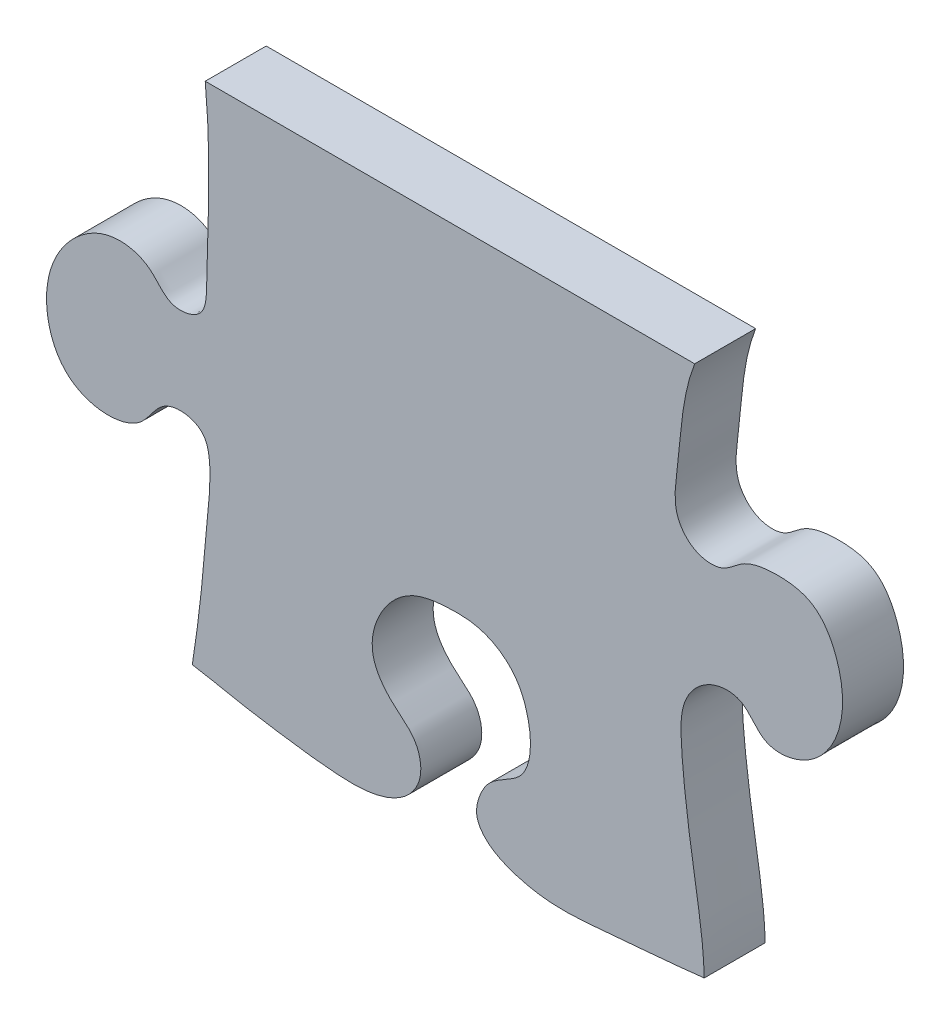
ISO-10303-21;
HEADER;
FILE_DESCRIPTION(('STEP AP214'),'2;1');
FILE_NAME('part.step','',(''),(''),'','','');
FILE_SCHEMA(('AUTOMOTIVE_DESIGN { 1 0 10303 214 1 1 1 1 }'));
ENDSEC;
DATA;
#1=APPLICATION_CONTEXT('core data for automotive mechanical design processes');
#2=APPLICATION_PROTOCOL_DEFINITION('international standard','automotive_design',2000,#1);
#3=PRODUCT_CONTEXT('',#1,'mechanical');
#4=PRODUCT('Part','Part','',(#3));
#5=PRODUCT_RELATED_PRODUCT_CATEGORY('part','',(#4));
#6=PRODUCT_DEFINITION_FORMATION('','',#4);
#7=PRODUCT_DEFINITION_CONTEXT('part definition',#1,'design');
#8=PRODUCT_DEFINITION('design','',#6,#7);
#9=PRODUCT_DEFINITION_SHAPE('','',#8);
#10=(LENGTH_UNIT() NAMED_UNIT(*) SI_UNIT(.MILLI.,.METRE.));
#11=(NAMED_UNIT(*) PLANE_ANGLE_UNIT() SI_UNIT($,.RADIAN.));
#12=(NAMED_UNIT(*) SI_UNIT($,.STERADIAN.) SOLID_ANGLE_UNIT());
#13=UNCERTAINTY_MEASURE_WITH_UNIT(LENGTH_MEASURE(1.E-05),#10,'distance_accuracy_value','');
#14=(GEOMETRIC_REPRESENTATION_CONTEXT(3) GLOBAL_UNCERTAINTY_ASSIGNED_CONTEXT((#13)) GLOBAL_UNIT_ASSIGNED_CONTEXT((#10,
#11,#12)) REPRESENTATION_CONTEXT('',''));
#15=CARTESIAN_POINT('',(0.,0.,0.));
#16=DIRECTION('',(0.,0.,1.));
#17=DIRECTION('',(1.,0.,0.));
#18=AXIS2_PLACEMENT_3D('',#15,#16,#17);
#19=CARTESIAN_POINT('',(325.257058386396,356.,-0.00999999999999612));
#20=CARTESIAN_POINT('',(320.961162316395,345.029410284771,-0.00999999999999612));
#21=CARTESIAN_POINT('',(320.821863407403,330.111228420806,-0.00999999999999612));
#22=CARTESIAN_POINT('',(317.746642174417,310.708405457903,-0.00999999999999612));
#23=CARTESIAN_POINT('',(324.80874526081,302.068845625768,-0.00999999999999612));
#24=CARTESIAN_POINT('',(334.47949844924,301.092198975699,-0.00999999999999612));
#25=CARTESIAN_POINT('',(341.199385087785,308.405018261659,-0.00999999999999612));
#26=CARTESIAN_POINT('',(351.88918877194,310.104343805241,-0.00999999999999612));
#27=CARTESIAN_POINT('',(365.477229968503,308.551893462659,-0.00999999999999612));
#28=CARTESIAN_POINT('',(373.973100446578,293.452904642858,-0.00999999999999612));
#29=CARTESIAN_POINT('',(374.68177629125,275.222888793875,-0.00999999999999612));
#30=CARTESIAN_POINT('',(363.969524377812,260.217712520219,-0.00999999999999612));
#31=CARTESIAN_POINT('',(347.560929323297,258.00994019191,-0.00999999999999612));
#32=CARTESIAN_POINT('',(341.667769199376,269.318092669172,-0.00999999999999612));
#33=CARTESIAN_POINT('',(329.050646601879,268.591464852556,-0.00999999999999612));
#34=CARTESIAN_POINT('',(320.333215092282,258.695380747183,-0.00999999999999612));
#35=CARTESIAN_POINT('',(321.071783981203,237.536716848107,-0.00999999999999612));
#36=CARTESIAN_POINT('',(324.445641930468,214.63289279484,-0.00999999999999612));
#37=CARTESIAN_POINT('',(329.382935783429,185.164436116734,-0.00999999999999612));
#38=CARTESIAN_POINT('',(327.148862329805,151.381238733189,-0.00999999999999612));
#39=CARTESIAN_POINT('',(325.104399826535,122.782989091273,-0.00999999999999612));
#40=CARTESIAN_POINT('',(327.870971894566,95.9027200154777,-0.00999999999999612));
#41=CARTESIAN_POINT('',(342.142457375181,93.3383677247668,-0.00999999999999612));
#42=CARTESIAN_POINT('',(347.900573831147,101.981576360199,-0.00999999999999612));
#43=CARTESIAN_POINT('',(356.834615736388,107.765098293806,-0.00999999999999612));
#44=CARTESIAN_POINT('',(369.379527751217,108.600772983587,-0.00999999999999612));
#45=CARTESIAN_POINT('',(380.120269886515,95.9775166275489,-0.00999999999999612));
#46=CARTESIAN_POINT('',(380.578851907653,78.7451628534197,-0.00999999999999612));
#47=CARTESIAN_POINT('',(375.610818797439,61.7248962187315,-0.00999999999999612));
#48=CARTESIAN_POINT('',(363.715824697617,52.8157722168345,-0.00999999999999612));
#49=CARTESIAN_POINT('',(349.85984979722,55.1705340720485,-0.00999999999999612));
#50=CARTESIAN_POINT('',(346.945856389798,64.810819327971,-0.00999999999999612));
#51=CARTESIAN_POINT('',(338.689797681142,70.9897723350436,-0.00999999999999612));
#52=CARTESIAN_POINT('',(330.580353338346,62.4728514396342,-0.00999999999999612));
#53=CARTESIAN_POINT('',(328.928359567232,48.4436203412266,-0.00999999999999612));
#54=CARTESIAN_POINT('',(329.318852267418,30.6791591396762,-0.00999999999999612));
#55=CARTESIAN_POINT('',(330.266196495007,6.75725364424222,-0.00999999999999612));
#56=CARTESIAN_POINT('',(328.413221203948,-22.8156731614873,-0.00999999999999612));
#57=CARTESIAN_POINT('',(325.957403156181,-47.4645191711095,-0.00999999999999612));
#58=CARTESIAN_POINT('',(324.284943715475,-71.7282942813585,-0.00999999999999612));
#59=CARTESIAN_POINT('',(336.158184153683,-74.5800053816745,-0.00999999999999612));
#60=CARTESIAN_POINT('',(345.605596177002,-70.2479425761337,-0.00999999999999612));
#61=CARTESIAN_POINT('',(352.349142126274,-60.6528291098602,-0.00999999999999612));
#62=CARTESIAN_POINT('',(364.054661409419,-61.084248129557,-0.00999999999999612));
#63=CARTESIAN_POINT('',(376.894401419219,-65.7171784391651,-0.00999999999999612));
#64=CARTESIAN_POINT('',(383.833690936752,-81.7570856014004,-0.00999999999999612));
#65=CARTESIAN_POINT('',(380.385627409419,-99.5380411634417,-0.00999999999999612));
#66=CARTESIAN_POINT('',(369.163029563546,-108.064440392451,-0.00999999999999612));
#67=CARTESIAN_POINT('',(355.487733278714,-112.894616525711,-0.00999999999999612));
#68=CARTESIAN_POINT('',(345.56890588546,-106.804716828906,-0.00999999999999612));
#69=CARTESIAN_POINT('',(337.864154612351,-99.6791187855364,-0.00999999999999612));
#70=CARTESIAN_POINT('',(325.333875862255,-101.340144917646,-0.00999999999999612));
#71=CARTESIAN_POINT('',(326.442256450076,-127.027418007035,-0.00999999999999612));
#72=CARTESIAN_POINT('',(328.990782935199,-147.650339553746,-0.00999999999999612));
#73=CARTESIAN_POINT('',(331.889209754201,-175.720931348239,-0.00999999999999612));
#74=CARTESIAN_POINT('',(333.49389611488,-200.043501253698,-0.00999999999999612));
#75=CARTESIAN_POINT('',(333.062418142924,-222.75850264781,-0.00999999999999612));
#76=CARTESIAN_POINT('',(334.041200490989,-241.335918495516,-0.00999999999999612));
#77=CARTESIAN_POINT('',(324.292862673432,-248.82670983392,-0.00999999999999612));
#78=CARTESIAN_POINT('',(313.862264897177,-249.831348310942,-0.00999999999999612));
#79=CARTESIAN_POINT('',(308.055191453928,-242.821422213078,-0.00999999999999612));
#80=CARTESIAN_POINT('',(300.480173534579,-235.015509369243,-0.00999999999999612));
#81=CARTESIAN_POINT('',(285.021810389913,-234.387092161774,-0.00999999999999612));
#82=CARTESIAN_POINT('',(274.179995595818,-248.432983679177,-0.00999999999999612));
#83=CARTESIAN_POINT('',(270.871780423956,-265.971502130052,-0.00999999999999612));
#84=CARTESIAN_POINT('',(274.212392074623,-284.032454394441,-0.00999999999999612));
#85=CARTESIAN_POINT('',(287.225269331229,-295.05235393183,-0.00999999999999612));
#86=CARTESIAN_POINT('',(300.809811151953,-292.931473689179,-0.00999999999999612));
#87=CARTESIAN_POINT('',(307.364923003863,-284.321305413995,-0.00999999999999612));
#88=CARTESIAN_POINT('',(317.634904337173,-281.646810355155,-0.00999999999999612));
#89=CARTESIAN_POINT('',(335.194502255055,-286.515768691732,-0.00999999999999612));
#90=CARTESIAN_POINT('',(329.900008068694,-321.054322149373,-0.00999999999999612));
#91=CARTESIAN_POINT('',(330.939416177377,-339.80390498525,-0.00999999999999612));
#92=CARTESIAN_POINT('',(328.124742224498,-356.,-0.00999999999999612));
#93=B_SPLINE_CURVE_WITH_KNOTS('',3,(#19,#20,#21,#22,#23,#24,#25,#26,#27,#28,#29,#30,#31,#32,#33,
#34,#35,#36,#37,#38,#39,#40,#41,#42,#43,#44,#45,#46,#47,#48,#49,#50,#51,#52,#53,#54,#55,#56,#57,
#58,#59,#60,#61,#62,#63,#64,#65,#66,#67,#68,#69,#70,#71,#72,#73,#74,#75,#76,#77,#78,#79,#80,#81,
#82,#83,#84,#85,#86,#87,#88,#89,#90,#91,#92),.UNSPECIFIED.,.F.,.F.,(4,1,1,1,1,1,1,1,1,1,1,1,1,1,
1,1,1,1,1,1,1,1,1,1,1,1,1,1,1,1,1,1,1,1,1,1,1,1,1,1,1,1,1,1,1,1,1,1,1,1,1,1,1,1,1,1,1,1,1,1,1,1,
1,1,1,1,1,1,1,1,1,4),(0.,0.0294359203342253,0.0410015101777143,0.0482578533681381,
0.056156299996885,0.0628725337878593,0.0726761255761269,0.0834491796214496,0.0961628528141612,
0.113582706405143,0.1292026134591,0.140393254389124,0.149299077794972,0.1578234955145,
0.168702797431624,0.18034067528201,0.211171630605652,0.230177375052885,0.258218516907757,
0.297936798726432,0.310855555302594,0.319545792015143,0.327782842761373,0.335750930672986,
0.347377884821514,0.35651553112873,0.375682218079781,0.389966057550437,0.401463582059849,
0.411615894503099,0.420595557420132,0.426581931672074,0.43417370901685,0.444880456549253,
0.464136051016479,0.480140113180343,0.507902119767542,0.539252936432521,0.552990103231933,
0.558383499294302,0.567729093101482,0.578921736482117,0.586248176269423,0.596305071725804,
0.613504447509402,0.626237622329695,0.64117705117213,0.647978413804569,0.662971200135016,
0.667795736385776,0.675224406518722,0.689293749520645,0.721613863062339,0.73643728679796,
0.762019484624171,0.785031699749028,0.797726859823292,0.806664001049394,0.814473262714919,
0.822386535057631,0.828765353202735,0.842978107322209,0.855573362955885,0.871677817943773,
0.889062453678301,0.900888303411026,0.912516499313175,0.920249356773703,0.928039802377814,
0.939164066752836,0.961164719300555,1.),.UNSPECIFIED.);
#94=DIRECTION('',(0.,0.,1.));
#95=VECTOR('',#94,1.);
#96=SURFACE_OF_LINEAR_EXTRUSION('',#93,#95);
#97=DIRECTION('',(0.,0.,1.));
#98=VECTOR('',#97,1.);
#99=CARTESIAN_POINT('',(328.393413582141,183.083092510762,-0.00999999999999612));
#100=LINE('',#99,#98);
#101=CARTESIAN_POINT('',(328.393413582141,183.083092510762,20.));
#102=VERTEX_POINT('',#101);
#103=CARTESIAN_POINT('',(328.393413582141,183.083092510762,0.));
#104=VERTEX_POINT('',#103);
#105=EDGE_CURVE('E81',#102,#104,#100,.F.);
#106=ORIENTED_EDGE('',*,*,#105,.T.);
#107=CARTESIAN_POINT('',(325.257058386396,356.,0.));
#108=CARTESIAN_POINT('',(320.961162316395,345.029410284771,0.));
#109=CARTESIAN_POINT('',(320.821863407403,330.111228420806,0.));
#110=CARTESIAN_POINT('',(317.746642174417,310.708405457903,0.));
#111=CARTESIAN_POINT('',(324.80874526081,302.068845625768,0.));
#112=CARTESIAN_POINT('',(334.47949844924,301.092198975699,0.));
#113=CARTESIAN_POINT('',(341.199385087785,308.405018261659,0.));
#114=CARTESIAN_POINT('',(351.88918877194,310.104343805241,0.));
#115=CARTESIAN_POINT('',(365.477229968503,308.551893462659,0.));
#116=CARTESIAN_POINT('',(373.973100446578,293.452904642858,0.));
#117=CARTESIAN_POINT('',(374.68177629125,275.222888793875,0.));
#118=CARTESIAN_POINT('',(363.969524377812,260.217712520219,0.));
#119=CARTESIAN_POINT('',(347.560929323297,258.00994019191,0.));
#120=CARTESIAN_POINT('',(341.667769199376,269.318092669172,0.));
#121=CARTESIAN_POINT('',(329.050646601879,268.591464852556,0.));
#122=CARTESIAN_POINT('',(320.333215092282,258.695380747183,0.));
#123=CARTESIAN_POINT('',(321.071783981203,237.536716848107,0.));
#124=CARTESIAN_POINT('',(324.445641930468,214.63289279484,0.));
#125=CARTESIAN_POINT('',(329.382935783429,185.164436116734,0.));
#126=CARTESIAN_POINT('',(327.148862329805,151.381238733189,0.));
#127=CARTESIAN_POINT('',(325.104399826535,122.782989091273,0.));
#128=CARTESIAN_POINT('',(327.870971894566,95.9027200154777,0.));
#129=CARTESIAN_POINT('',(342.142457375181,93.3383677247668,0.));
#130=CARTESIAN_POINT('',(347.900573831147,101.981576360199,0.));
#131=CARTESIAN_POINT('',(356.834615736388,107.765098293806,0.));
#132=CARTESIAN_POINT('',(369.379527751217,108.600772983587,0.));
#133=CARTESIAN_POINT('',(380.120269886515,95.9775166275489,0.));
#134=CARTESIAN_POINT('',(380.578851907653,78.7451628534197,0.));
#135=CARTESIAN_POINT('',(375.610818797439,61.7248962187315,0.));
#136=CARTESIAN_POINT('',(363.715824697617,52.8157722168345,0.));
#137=CARTESIAN_POINT('',(349.85984979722,55.1705340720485,0.));
#138=CARTESIAN_POINT('',(346.945856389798,64.810819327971,0.));
#139=CARTESIAN_POINT('',(338.689797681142,70.9897723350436,0.));
#140=CARTESIAN_POINT('',(330.580353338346,62.4728514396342,0.));
#141=CARTESIAN_POINT('',(328.928359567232,48.4436203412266,0.));
#142=CARTESIAN_POINT('',(329.318852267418,30.6791591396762,0.));
#143=CARTESIAN_POINT('',(330.266196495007,6.75725364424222,0.));
#144=CARTESIAN_POINT('',(328.413221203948,-22.8156731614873,0.));
#145=CARTESIAN_POINT('',(325.957403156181,-47.4645191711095,0.));
#146=CARTESIAN_POINT('',(324.284943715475,-71.7282942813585,0.));
#147=CARTESIAN_POINT('',(336.158184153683,-74.5800053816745,0.));
#148=CARTESIAN_POINT('',(345.605596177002,-70.2479425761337,0.));
#149=CARTESIAN_POINT('',(352.349142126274,-60.6528291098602,0.));
#150=CARTESIAN_POINT('',(364.054661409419,-61.084248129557,0.));
#151=CARTESIAN_POINT('',(376.894401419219,-65.7171784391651,0.));
#152=CARTESIAN_POINT('',(383.833690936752,-81.7570856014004,0.));
#153=CARTESIAN_POINT('',(380.385627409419,-99.5380411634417,0.));
#154=CARTESIAN_POINT('',(369.163029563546,-108.064440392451,0.));
#155=CARTESIAN_POINT('',(355.487733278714,-112.894616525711,0.));
#156=CARTESIAN_POINT('',(345.56890588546,-106.804716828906,0.));
#157=CARTESIAN_POINT('',(337.864154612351,-99.6791187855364,0.));
#158=CARTESIAN_POINT('',(325.333875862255,-101.340144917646,0.));
#159=CARTESIAN_POINT('',(326.442256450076,-127.027418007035,0.));
#160=CARTESIAN_POINT('',(328.990782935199,-147.650339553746,0.));
#161=CARTESIAN_POINT('',(331.889209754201,-175.720931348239,0.));
#162=CARTESIAN_POINT('',(333.49389611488,-200.043501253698,0.));
#163=CARTESIAN_POINT('',(333.062418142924,-222.75850264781,0.));
#164=CARTESIAN_POINT('',(334.041200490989,-241.335918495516,0.));
#165=CARTESIAN_POINT('',(324.292862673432,-248.82670983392,0.));
#166=CARTESIAN_POINT('',(313.862264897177,-249.831348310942,0.));
#167=CARTESIAN_POINT('',(308.055191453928,-242.821422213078,0.));
#168=CARTESIAN_POINT('',(300.480173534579,-235.015509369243,0.));
#169=CARTESIAN_POINT('',(285.021810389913,-234.387092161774,0.));
#170=CARTESIAN_POINT('',(274.179995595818,-248.432983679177,0.));
#171=CARTESIAN_POINT('',(270.871780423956,-265.971502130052,0.));
#172=CARTESIAN_POINT('',(274.212392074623,-284.032454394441,0.));
#173=CARTESIAN_POINT('',(287.225269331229,-295.05235393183,0.));
#174=CARTESIAN_POINT('',(300.809811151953,-292.931473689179,0.));
#175=CARTESIAN_POINT('',(307.364923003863,-284.321305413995,0.));
#176=CARTESIAN_POINT('',(317.634904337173,-281.646810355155,0.));
#177=CARTESIAN_POINT('',(335.194502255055,-286.515768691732,0.));
#178=CARTESIAN_POINT('',(329.900008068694,-321.054322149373,0.));
#179=CARTESIAN_POINT('',(330.939416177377,-339.80390498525,0.));
#180=CARTESIAN_POINT('',(328.124742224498,-356.,0.));
#181=B_SPLINE_CURVE_WITH_KNOTS('',3,(#107,#108,#109,#110,#111,#112,#113,#114,#115,#116,#117,
#118,#119,#120,#121,#122,#123,#124,#125,#126,#127,#128,#129,#130,#131,#132,#133,#134,#135,#136,
#137,#138,#139,#140,#141,#142,#143,#144,#145,#146,#147,#148,#149,#150,#151,#152,#153,#154,#155,
#156,#157,#158,#159,#160,#161,#162,#163,#164,#165,#166,#167,#168,#169,#170,#171,#172,#173,#174,
#175,#176,#177,#178,#179,#180),.UNSPECIFIED.,.F.,.F.,(4,1,1,1,1,1,1,1,1,1,1,1,1,1,1,1,1,1,1,1,1,
1,1,1,1,1,1,1,1,1,1,1,1,1,1,1,1,1,1,1,1,1,1,1,1,1,1,1,1,1,1,1,1,1,1,1,1,1,1,1,1,1,1,1,1,1,1,1,1,
1,1,4),(0.,0.0294359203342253,0.0410015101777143,0.0482578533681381,0.056156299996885,
0.0628725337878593,0.0726761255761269,0.0834491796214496,0.0961628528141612,0.113582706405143,
0.1292026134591,0.140393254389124,0.149299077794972,0.1578234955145,0.168702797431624,
0.18034067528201,0.211171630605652,0.230177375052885,0.258218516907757,0.297936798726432,
0.310855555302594,0.319545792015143,0.327782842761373,0.335750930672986,0.347377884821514,
0.35651553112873,0.375682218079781,0.389966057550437,0.401463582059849,0.411615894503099,
0.420595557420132,0.426581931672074,0.43417370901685,0.444880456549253,0.464136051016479,
0.480140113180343,0.507902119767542,0.539252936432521,0.552990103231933,0.558383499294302,
0.567729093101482,0.578921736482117,0.586248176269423,0.596305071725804,0.613504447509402,
0.626237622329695,0.64117705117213,0.647978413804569,0.662971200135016,0.667795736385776,
0.675224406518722,0.689293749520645,0.721613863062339,0.73643728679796,0.762019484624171,
0.785031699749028,0.797726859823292,0.806664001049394,0.814473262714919,0.822386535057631,
0.828765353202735,0.842978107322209,0.855573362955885,0.871677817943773,0.889062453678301,
0.900888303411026,0.912516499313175,0.920249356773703,0.928039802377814,0.939164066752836,
0.961164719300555,1.),.UNSPECIFIED.);
#182=CARTESIAN_POINT('',(325.257058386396,356.,0.));
#183=VERTEX_POINT('',#182);
#184=EDGE_CURVE('E117',#183,#104,#181,.T.);
#185=ORIENTED_EDGE('',*,*,#184,.F.);
#186=DIRECTION('',(0.,0.,1.));
#187=VECTOR('',#186,1.);
#188=CARTESIAN_POINT('',(325.257058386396,356.,-0.00999999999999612));
#189=LINE('',#188,#187);
#190=CARTESIAN_POINT('',(325.257058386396,356.,20.));
#191=VERTEX_POINT('',#190);
#192=EDGE_CURVE('E82',#191,#183,#189,.F.);
#193=ORIENTED_EDGE('',*,*,#192,.F.);
#194=CARTESIAN_POINT('',(325.257058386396,356.,20.));
#195=CARTESIAN_POINT('',(320.961162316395,345.029410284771,20.));
#196=CARTESIAN_POINT('',(320.821863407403,330.111228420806,20.));
#197=CARTESIAN_POINT('',(317.746642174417,310.708405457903,20.));
#198=CARTESIAN_POINT('',(324.80874526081,302.068845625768,20.));
#199=CARTESIAN_POINT('',(334.47949844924,301.092198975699,20.));
#200=CARTESIAN_POINT('',(341.199385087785,308.405018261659,20.));
#201=CARTESIAN_POINT('',(351.88918877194,310.104343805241,20.));
#202=CARTESIAN_POINT('',(365.477229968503,308.551893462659,20.));
#203=CARTESIAN_POINT('',(373.973100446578,293.452904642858,20.));
#204=CARTESIAN_POINT('',(374.68177629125,275.222888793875,20.));
#205=CARTESIAN_POINT('',(363.969524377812,260.217712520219,20.));
#206=CARTESIAN_POINT('',(347.560929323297,258.00994019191,20.));
#207=CARTESIAN_POINT('',(341.667769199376,269.318092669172,20.));
#208=CARTESIAN_POINT('',(329.050646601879,268.591464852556,20.));
#209=CARTESIAN_POINT('',(320.333215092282,258.695380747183,20.));
#210=CARTESIAN_POINT('',(321.071783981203,237.536716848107,20.));
#211=CARTESIAN_POINT('',(324.445641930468,214.63289279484,20.));
#212=CARTESIAN_POINT('',(329.382935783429,185.164436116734,20.));
#213=CARTESIAN_POINT('',(327.148862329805,151.381238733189,20.));
#214=CARTESIAN_POINT('',(325.104399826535,122.782989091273,20.));
#215=CARTESIAN_POINT('',(327.870971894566,95.9027200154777,20.));
#216=CARTESIAN_POINT('',(342.142457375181,93.3383677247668,20.));
#217=CARTESIAN_POINT('',(347.900573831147,101.981576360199,20.));
#218=CARTESIAN_POINT('',(356.834615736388,107.765098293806,20.));
#219=CARTESIAN_POINT('',(369.379527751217,108.600772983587,20.));
#220=CARTESIAN_POINT('',(380.120269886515,95.9775166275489,20.));
#221=CARTESIAN_POINT('',(380.578851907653,78.7451628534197,20.));
#222=CARTESIAN_POINT('',(375.610818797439,61.7248962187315,20.));
#223=CARTESIAN_POINT('',(363.715824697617,52.8157722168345,20.));
#224=CARTESIAN_POINT('',(349.85984979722,55.1705340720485,20.));
#225=CARTESIAN_POINT('',(346.945856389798,64.810819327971,20.));
#226=CARTESIAN_POINT('',(338.689797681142,70.9897723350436,20.));
#227=CARTESIAN_POINT('',(330.580353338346,62.4728514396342,20.));
#228=CARTESIAN_POINT('',(328.928359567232,48.4436203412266,20.));
#229=CARTESIAN_POINT('',(329.318852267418,30.6791591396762,20.));
#230=CARTESIAN_POINT('',(330.266196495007,6.75725364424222,20.));
#231=CARTESIAN_POINT('',(328.413221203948,-22.8156731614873,20.));
#232=CARTESIAN_POINT('',(325.957403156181,-47.4645191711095,20.));
#233=CARTESIAN_POINT('',(324.284943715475,-71.7282942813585,20.));
#234=CARTESIAN_POINT('',(336.158184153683,-74.5800053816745,20.));
#235=CARTESIAN_POINT('',(345.605596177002,-70.2479425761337,20.));
#236=CARTESIAN_POINT('',(352.349142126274,-60.6528291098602,20.));
#237=CARTESIAN_POINT('',(364.054661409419,-61.084248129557,20.));
#238=CARTESIAN_POINT('',(376.894401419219,-65.7171784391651,20.));
#239=CARTESIAN_POINT('',(383.833690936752,-81.7570856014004,20.));
#240=CARTESIAN_POINT('',(380.385627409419,-99.5380411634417,20.));
#241=CARTESIAN_POINT('',(369.163029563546,-108.064440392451,20.));
#242=CARTESIAN_POINT('',(355.487733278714,-112.894616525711,20.));
#243=CARTESIAN_POINT('',(345.56890588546,-106.804716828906,20.));
#244=CARTESIAN_POINT('',(337.864154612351,-99.6791187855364,20.));
#245=CARTESIAN_POINT('',(325.333875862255,-101.340144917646,20.));
#246=CARTESIAN_POINT('',(326.442256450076,-127.027418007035,20.));
#247=CARTESIAN_POINT('',(328.990782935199,-147.650339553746,20.));
#248=CARTESIAN_POINT('',(331.889209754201,-175.720931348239,20.));
#249=CARTESIAN_POINT('',(333.49389611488,-200.043501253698,20.));
#250=CARTESIAN_POINT('',(333.062418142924,-222.75850264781,20.));
#251=CARTESIAN_POINT('',(334.041200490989,-241.335918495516,20.));
#252=CARTESIAN_POINT('',(324.292862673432,-248.82670983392,20.));
#253=CARTESIAN_POINT('',(313.862264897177,-249.831348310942,20.));
#254=CARTESIAN_POINT('',(308.055191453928,-242.821422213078,20.));
#255=CARTESIAN_POINT('',(300.480173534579,-235.015509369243,20.));
#256=CARTESIAN_POINT('',(285.021810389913,-234.387092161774,20.));
#257=CARTESIAN_POINT('',(274.179995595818,-248.432983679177,20.));
#258=CARTESIAN_POINT('',(270.871780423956,-265.971502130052,20.));
#259=CARTESIAN_POINT('',(274.212392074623,-284.032454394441,20.));
#260=CARTESIAN_POINT('',(287.225269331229,-295.05235393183,20.));
#261=CARTESIAN_POINT('',(300.809811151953,-292.931473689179,20.));
#262=CARTESIAN_POINT('',(307.364923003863,-284.321305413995,20.));
#263=CARTESIAN_POINT('',(317.634904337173,-281.646810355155,20.));
#264=CARTESIAN_POINT('',(335.194502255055,-286.515768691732,20.));
#265=CARTESIAN_POINT('',(329.900008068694,-321.054322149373,20.));
#266=CARTESIAN_POINT('',(330.939416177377,-339.80390498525,20.));
#267=CARTESIAN_POINT('',(328.124742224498,-356.,20.));
#268=B_SPLINE_CURVE_WITH_KNOTS('',3,(#194,#195,#196,#197,#198,#199,#200,#201,#202,#203,#204,
#205,#206,#207,#208,#209,#210,#211,#212,#213,#214,#215,#216,#217,#218,#219,#220,#221,#222,#223,
#224,#225,#226,#227,#228,#229,#230,#231,#232,#233,#234,#235,#236,#237,#238,#239,#240,#241,#242,
#243,#244,#245,#246,#247,#248,#249,#250,#251,#252,#253,#254,#255,#256,#257,#258,#259,#260,#261,
#262,#263,#264,#265,#266,#267),.UNSPECIFIED.,.F.,.F.,(4,1,1,1,1,1,1,1,1,1,1,1,1,1,1,1,1,1,1,1,1,
1,1,1,1,1,1,1,1,1,1,1,1,1,1,1,1,1,1,1,1,1,1,1,1,1,1,1,1,1,1,1,1,1,1,1,1,1,1,1,1,1,1,1,1,1,1,1,1,
1,1,4),(0.,0.0294359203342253,0.0410015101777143,0.0482578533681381,0.056156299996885,
0.0628725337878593,0.0726761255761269,0.0834491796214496,0.0961628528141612,0.113582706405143,
0.1292026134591,0.140393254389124,0.149299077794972,0.1578234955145,0.168702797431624,
0.18034067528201,0.211171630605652,0.230177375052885,0.258218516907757,0.297936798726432,
0.310855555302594,0.319545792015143,0.327782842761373,0.335750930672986,0.347377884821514,
0.35651553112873,0.375682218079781,0.389966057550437,0.401463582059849,0.411615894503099,
0.420595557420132,0.426581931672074,0.43417370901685,0.444880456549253,0.464136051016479,
0.480140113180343,0.507902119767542,0.539252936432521,0.552990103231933,0.558383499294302,
0.567729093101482,0.578921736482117,0.586248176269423,0.596305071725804,0.613504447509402,
0.626237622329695,0.64117705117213,0.647978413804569,0.662971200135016,0.667795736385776,
0.675224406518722,0.689293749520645,0.721613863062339,0.73643728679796,0.762019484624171,
0.785031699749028,0.797726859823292,0.806664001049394,0.814473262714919,0.822386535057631,
0.828765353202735,0.842978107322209,0.855573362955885,0.871677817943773,0.889062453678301,
0.900888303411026,0.912516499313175,0.920249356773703,0.928039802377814,0.939164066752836,
0.961164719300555,1.),.UNSPECIFIED.);
#269=EDGE_CURVE('E38',#191,#102,#268,.T.);
#270=ORIENTED_EDGE('',*,*,#269,.T.);
#271=EDGE_LOOP('',(#106,#185,#193,#270));
#272=FACE_BOUND('',#271,.T.);
#273=ADVANCED_FACE('F34',(#272),#96,.F.);
#274=CARTESIAN_POINT('',(164.700455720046,356.,-0.00999999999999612));
#275=CARTESIAN_POINT('',(166.684488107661,335.198470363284,-0.00999999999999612));
#276=CARTESIAN_POINT('',(165.501961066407,316.54844325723,-0.00999999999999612));
#277=CARTESIAN_POINT('',(164.960386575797,287.97241381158,-0.00999999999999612));
#278=CARTESIAN_POINT('',(152.647306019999,285.390744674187,-0.00999999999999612));
#279=CARTESIAN_POINT('',(146.755099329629,295.454986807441,-0.00999999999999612));
#280=CARTESIAN_POINT('',(133.057911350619,298.241097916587,-0.00999999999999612));
#281=CARTESIAN_POINT('',(118.543117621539,289.096389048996,-0.00999999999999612));
#282=CARTESIAN_POINT('',(110.066069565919,270.786201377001,-0.00999999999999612));
#283=CARTESIAN_POINT('',(115.81886117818,249.01949577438,-0.00999999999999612));
#284=CARTESIAN_POINT('',(132.43055469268,243.861484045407,-0.00999999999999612));
#285=CARTESIAN_POINT('',(145.190771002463,247.721589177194,-0.00999999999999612));
#286=CARTESIAN_POINT('',(150.073688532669,259.755128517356,-0.00999999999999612));
#287=CARTESIAN_POINT('',(164.873456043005,258.011209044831,-0.00999999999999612));
#288=CARTESIAN_POINT('',(166.852874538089,244.914449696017,-0.00999999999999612));
#289=CARTESIAN_POINT('',(165.64887314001,235.496089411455,-0.00999999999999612));
#290=CARTESIAN_POINT('',(164.287273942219,218.693357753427,-0.00999999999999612));
#291=CARTESIAN_POINT('',(162.190296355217,197.368034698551,-0.00999999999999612));
#292=CARTESIAN_POINT('',(156.3242571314,163.987545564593,-0.00999999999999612));
#293=CARTESIAN_POINT('',(154.411282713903,133.17643128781,-0.00999999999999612));
#294=CARTESIAN_POINT('',(156.534624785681,107.79955112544,-0.00999999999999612));
#295=CARTESIAN_POINT('',(165.683431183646,96.7362595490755,-0.00999999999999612));
#296=CARTESIAN_POINT('',(175.741034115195,97.7165246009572,-0.00999999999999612));
#297=CARTESIAN_POINT('',(178.913476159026,105.433342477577,-0.00999999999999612));
#298=CARTESIAN_POINT('',(187.788546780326,107.088038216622,-0.00999999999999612));
#299=CARTESIAN_POINT('',(196.945345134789,104.662624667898,-0.00999999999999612));
#300=CARTESIAN_POINT('',(205.29981235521,92.5405980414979,-0.00999999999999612));
#301=CARTESIAN_POINT('',(205.41693478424,76.2178133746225,-0.00999999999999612));
#302=CARTESIAN_POINT('',(199.239540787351,59.8870096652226,-0.00999999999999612));
#303=CARTESIAN_POINT('',(186.871281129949,54.774238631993,-0.00999999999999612));
#304=CARTESIAN_POINT('',(176.156697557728,56.844920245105,-0.00999999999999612));
#305=CARTESIAN_POINT('',(170.099360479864,65.2771221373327,-0.00999999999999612));
#306=CARTESIAN_POINT('',(157.970826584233,62.7514417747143,-0.00999999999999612));
#307=CARTESIAN_POINT('',(154.504441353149,46.6972732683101,-0.00999999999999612));
#308=CARTESIAN_POINT('',(156.826886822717,28.5222575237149,-0.00999999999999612));
#309=CARTESIAN_POINT('',(160.951813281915,-0.904965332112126,-0.00999999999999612));
#310=CARTESIAN_POINT('',(160.817443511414,-23.2712614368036,-0.00999999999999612));
#311=CARTESIAN_POINT('',(159.515162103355,-48.5242453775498,-0.00999999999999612));
#312=CARTESIAN_POINT('',(159.855435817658,-66.2012023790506,-0.00999999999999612));
#313=CARTESIAN_POINT('',(174.098925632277,-64.1326131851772,-0.00999999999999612));
#314=CARTESIAN_POINT('',(178.558905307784,-57.1982656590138,-0.00999999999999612));
#315=CARTESIAN_POINT('',(189.170801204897,-53.4758485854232,-0.00999999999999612));
#316=CARTESIAN_POINT('',(204.121791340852,-56.9229006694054,-0.00999999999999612));
#317=CARTESIAN_POINT('',(214.382314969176,-74.3254117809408,-0.00999999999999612));
#318=CARTESIAN_POINT('',(212.434433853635,-94.56819618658,-0.00999999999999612));
#319=CARTESIAN_POINT('',(198.400882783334,-105.927100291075,-0.00999999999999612));
#320=CARTESIAN_POINT('',(183.864051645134,-103.318484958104,-0.00999999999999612));
#321=CARTESIAN_POINT('',(177.484460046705,-92.9196706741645,-0.00999999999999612));
#322=CARTESIAN_POINT('',(166.612136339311,-90.3684772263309,-0.00999999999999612));
#323=CARTESIAN_POINT('',(160.072685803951,-95.573386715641,-0.00999999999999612));
#324=CARTESIAN_POINT('',(159.605088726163,-111.518801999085,-0.00999999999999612));
#325=CARTESIAN_POINT('',(161.971531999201,-132.152629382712,-0.00999999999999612));
#326=CARTESIAN_POINT('',(165.531009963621,-165.300059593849,-0.00999999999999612));
#327=CARTESIAN_POINT('',(167.927544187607,-195.365052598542,-0.00999999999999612));
#328=CARTESIAN_POINT('',(172.57489134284,-240.687787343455,-0.00999999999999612));
#329=CARTESIAN_POINT('',(151.998880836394,-237.677540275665,-0.00999999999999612));
#330=CARTESIAN_POINT('',(144.556929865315,-230.426442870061,-0.00999999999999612));
#331=CARTESIAN_POINT('',(127.822205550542,-229.966972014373,-0.00999999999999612));
#332=CARTESIAN_POINT('',(119.338975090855,-241.300441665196,-0.00999999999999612));
#333=CARTESIAN_POINT('',(116.55363668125,-259.024274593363,-0.00999999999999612));
#334=CARTESIAN_POINT('',(116.920126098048,-276.665079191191,-0.00999999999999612));
#335=CARTESIAN_POINT('',(139.807593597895,-286.808161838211,-0.00999999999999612));
#336=CARTESIAN_POINT('',(149.426451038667,-271.120437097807,-0.00999999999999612));
#337=CARTESIAN_POINT('',(164.833722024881,-276.098774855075,-0.00999999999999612));
#338=CARTESIAN_POINT('',(167.534498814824,-298.611176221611,-0.00999999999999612));
#339=CARTESIAN_POINT('',(167.66539945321,-324.44648435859,-0.00999999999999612));
#340=CARTESIAN_POINT('',(167.206886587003,-345.801767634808,-0.00999999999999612));
#341=CARTESIAN_POINT('',(167.126415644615,-356.,-0.00999999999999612));
#342=B_SPLINE_CURVE_WITH_KNOTS('',3,(#274,#275,#276,#277,#278,#279,#280,#281,#282,#283,#284,
#285,#286,#287,#288,#289,#290,#291,#292,#293,#294,#295,#296,#297,#298,#299,#300,#301,#302,#303,
#304,#305,#306,#307,#308,#309,#310,#311,#312,#313,#314,#315,#316,#317,#318,#319,#320,#321,#322,
#323,#324,#325,#326,#327,#328,#329,#330,#331,#332,#333,#334,#335,#336,#337,#338,#339,#340,#341),
.UNSPECIFIED.,.F.,.F.,(4,1,1,1,1,1,1,1,1,1,1,1,1,1,1,1,1,1,1,1,1,1,1,1,1,1,1,1,1,1,1,1,1,1,1,1,
1,1,1,1,1,1,1,1,1,1,1,1,1,1,1,1,1,1,1,1,1,1,1,1,1,1,1,1,1,4),(0.,0.0528861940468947,
0.0611638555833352,0.0696733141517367,0.078438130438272,0.090018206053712,0.103675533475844,
0.122333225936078,0.142560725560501,0.155895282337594,0.165515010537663,0.176439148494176,
0.187171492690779,0.194785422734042,0.209132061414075,0.213814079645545,0.241605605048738,
0.267229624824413,0.306753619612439,0.326390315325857,0.335466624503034,0.342457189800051,
0.349640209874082,0.355564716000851,0.365339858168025,0.374043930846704,0.393709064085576,
0.408072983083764,0.418687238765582,0.427525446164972,0.43602306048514,0.444515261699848,
0.454494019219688,0.476412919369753,0.496275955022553,0.534624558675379,0.541144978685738,
0.561480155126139,0.567662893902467,0.574392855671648,0.583113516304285,0.596680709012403,
0.612912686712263,0.634082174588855,0.646626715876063,0.657822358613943,0.669754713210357,
0.678210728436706,0.685129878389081,0.689092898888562,0.71784093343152,0.747115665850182,
0.77522808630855,0.815611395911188,0.819725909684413,0.828398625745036,0.84335213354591,
0.85870373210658,0.863219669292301,0.888511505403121,0.901615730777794,0.918667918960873,
0.92637935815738,0.939283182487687,0.973955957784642,1.),.UNSPECIFIED.);
#343=DIRECTION('',(0.,0.,1.));
#344=VECTOR('',#343,1.);
#345=SURFACE_OF_LINEAR_EXTRUSION('',#342,#344);
#346=DIRECTION('',(0.,0.,1.));
#347=VECTOR('',#346,1.);
#348=CARTESIAN_POINT('',(160.461892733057,188.122695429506,-0.00999999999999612));
#349=LINE('',#348,#347);
#350=CARTESIAN_POINT('',(160.461892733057,188.122695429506,20.));
#351=VERTEX_POINT('',#350);
#352=CARTESIAN_POINT('',(160.461892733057,188.122695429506,0.));
#353=VERTEX_POINT('',#352);
#354=EDGE_CURVE('E89',#351,#353,#349,.F.);
#355=ORIENTED_EDGE('',*,*,#354,.F.);
#356=CARTESIAN_POINT('',(164.700455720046,356.,20.));
#357=CARTESIAN_POINT('',(166.684488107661,335.198470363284,20.));
#358=CARTESIAN_POINT('',(165.501961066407,316.54844325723,20.));
#359=CARTESIAN_POINT('',(164.960386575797,287.97241381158,20.));
#360=CARTESIAN_POINT('',(152.647306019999,285.390744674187,20.));
#361=CARTESIAN_POINT('',(146.755099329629,295.454986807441,20.));
#362=CARTESIAN_POINT('',(133.057911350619,298.241097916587,20.));
#363=CARTESIAN_POINT('',(118.543117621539,289.096389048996,20.));
#364=CARTESIAN_POINT('',(110.066069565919,270.786201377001,20.));
#365=CARTESIAN_POINT('',(115.81886117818,249.01949577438,20.));
#366=CARTESIAN_POINT('',(132.43055469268,243.861484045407,20.));
#367=CARTESIAN_POINT('',(145.190771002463,247.721589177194,20.));
#368=CARTESIAN_POINT('',(150.073688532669,259.755128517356,20.));
#369=CARTESIAN_POINT('',(164.873456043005,258.011209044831,20.));
#370=CARTESIAN_POINT('',(166.852874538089,244.914449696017,20.));
#371=CARTESIAN_POINT('',(165.64887314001,235.496089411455,20.));
#372=CARTESIAN_POINT('',(164.287273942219,218.693357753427,20.));
#373=CARTESIAN_POINT('',(162.190296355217,197.368034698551,20.));
#374=CARTESIAN_POINT('',(156.3242571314,163.987545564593,20.));
#375=CARTESIAN_POINT('',(154.411282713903,133.17643128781,20.));
#376=CARTESIAN_POINT('',(156.534624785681,107.79955112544,20.));
#377=CARTESIAN_POINT('',(165.683431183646,96.7362595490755,20.));
#378=CARTESIAN_POINT('',(175.741034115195,97.7165246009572,20.));
#379=CARTESIAN_POINT('',(178.913476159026,105.433342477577,20.));
#380=CARTESIAN_POINT('',(187.788546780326,107.088038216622,20.));
#381=CARTESIAN_POINT('',(196.945345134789,104.662624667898,20.));
#382=CARTESIAN_POINT('',(205.29981235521,92.5405980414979,20.));
#383=CARTESIAN_POINT('',(205.41693478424,76.2178133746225,20.));
#384=CARTESIAN_POINT('',(199.239540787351,59.8870096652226,20.));
#385=CARTESIAN_POINT('',(186.871281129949,54.774238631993,20.));
#386=CARTESIAN_POINT('',(176.156697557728,56.844920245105,20.));
#387=CARTESIAN_POINT('',(170.099360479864,65.2771221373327,20.));
#388=CARTESIAN_POINT('',(157.970826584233,62.7514417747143,20.));
#389=CARTESIAN_POINT('',(154.504441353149,46.6972732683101,20.));
#390=CARTESIAN_POINT('',(156.826886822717,28.5222575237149,20.));
#391=CARTESIAN_POINT('',(160.951813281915,-0.904965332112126,20.));
#392=CARTESIAN_POINT('',(160.817443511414,-23.2712614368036,20.));
#393=CARTESIAN_POINT('',(159.515162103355,-48.5242453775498,20.));
#394=CARTESIAN_POINT('',(159.855435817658,-66.2012023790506,20.));
#395=CARTESIAN_POINT('',(174.098925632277,-64.1326131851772,20.));
#396=CARTESIAN_POINT('',(178.558905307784,-57.1982656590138,20.));
#397=CARTESIAN_POINT('',(189.170801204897,-53.4758485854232,20.));
#398=CARTESIAN_POINT('',(204.121791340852,-56.9229006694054,20.));
#399=CARTESIAN_POINT('',(214.382314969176,-74.3254117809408,20.));
#400=CARTESIAN_POINT('',(212.434433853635,-94.56819618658,20.));
#401=CARTESIAN_POINT('',(198.400882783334,-105.927100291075,20.));
#402=CARTESIAN_POINT('',(183.864051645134,-103.318484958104,20.));
#403=CARTESIAN_POINT('',(177.484460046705,-92.9196706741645,20.));
#404=CARTESIAN_POINT('',(166.612136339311,-90.3684772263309,20.));
#405=CARTESIAN_POINT('',(160.072685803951,-95.573386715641,20.));
#406=CARTESIAN_POINT('',(159.605088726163,-111.518801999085,20.));
#407=CARTESIAN_POINT('',(161.971531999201,-132.152629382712,20.));
#408=CARTESIAN_POINT('',(165.531009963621,-165.300059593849,20.));
#409=CARTESIAN_POINT('',(167.927544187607,-195.365052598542,20.));
#410=CARTESIAN_POINT('',(172.57489134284,-240.687787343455,20.));
#411=CARTESIAN_POINT('',(151.998880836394,-237.677540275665,20.));
#412=CARTESIAN_POINT('',(144.556929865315,-230.426442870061,20.));
#413=CARTESIAN_POINT('',(127.822205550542,-229.966972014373,20.));
#414=CARTESIAN_POINT('',(119.338975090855,-241.300441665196,20.));
#415=CARTESIAN_POINT('',(116.55363668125,-259.024274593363,20.));
#416=CARTESIAN_POINT('',(116.920126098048,-276.665079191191,20.));
#417=CARTESIAN_POINT('',(139.807593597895,-286.808161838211,20.));
#418=CARTESIAN_POINT('',(149.426451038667,-271.120437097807,20.));
#419=CARTESIAN_POINT('',(164.833722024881,-276.098774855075,20.));
#420=CARTESIAN_POINT('',(167.534498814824,-298.611176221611,20.));
#421=CARTESIAN_POINT('',(167.66539945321,-324.44648435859,20.));
#422=CARTESIAN_POINT('',(167.206886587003,-345.801767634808,20.));
#423=CARTESIAN_POINT('',(167.126415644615,-356.,20.));
#424=B_SPLINE_CURVE_WITH_KNOTS('',3,(#356,#357,#358,#359,#360,#361,#362,#363,#364,#365,#366,
#367,#368,#369,#370,#371,#372,#373,#374,#375,#376,#377,#378,#379,#380,#381,#382,#383,#384,#385,
#386,#387,#388,#389,#390,#391,#392,#393,#394,#395,#396,#397,#398,#399,#400,#401,#402,#403,#404,
#405,#406,#407,#408,#409,#410,#411,#412,#413,#414,#415,#416,#417,#418,#419,#420,#421,#422,#423),
.UNSPECIFIED.,.F.,.F.,(4,1,1,1,1,1,1,1,1,1,1,1,1,1,1,1,1,1,1,1,1,1,1,1,1,1,1,1,1,1,1,1,1,1,1,1,
1,1,1,1,1,1,1,1,1,1,1,1,1,1,1,1,1,1,1,1,1,1,1,1,1,1,1,1,1,4),(0.,0.0528861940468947,
0.0611638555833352,0.0696733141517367,0.078438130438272,0.090018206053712,0.103675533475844,
0.122333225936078,0.142560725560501,0.155895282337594,0.165515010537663,0.176439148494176,
0.187171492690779,0.194785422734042,0.209132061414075,0.213814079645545,0.241605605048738,
0.267229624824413,0.306753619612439,0.326390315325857,0.335466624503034,0.342457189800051,
0.349640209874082,0.355564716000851,0.365339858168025,0.374043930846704,0.393709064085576,
0.408072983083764,0.418687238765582,0.427525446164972,0.43602306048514,0.444515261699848,
0.454494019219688,0.476412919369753,0.496275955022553,0.534624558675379,0.541144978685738,
0.561480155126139,0.567662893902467,0.574392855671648,0.583113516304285,0.596680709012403,
0.612912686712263,0.634082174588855,0.646626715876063,0.657822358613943,0.669754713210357,
0.678210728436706,0.685129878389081,0.689092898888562,0.71784093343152,0.747115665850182,
0.77522808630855,0.815611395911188,0.819725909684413,0.828398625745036,0.84335213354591,
0.85870373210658,0.863219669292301,0.888511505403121,0.901615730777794,0.918667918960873,
0.92637935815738,0.939283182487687,0.973955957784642,1.),.UNSPECIFIED.);
#425=CARTESIAN_POINT('',(164.700455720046,356.,20.));
#426=VERTEX_POINT('',#425);
#427=EDGE_CURVE('E53',#426,#351,#424,.T.);
#428=ORIENTED_EDGE('',*,*,#427,.F.);
#429=DIRECTION('',(0.,0.,1.));
#430=VECTOR('',#429,1.);
#431=CARTESIAN_POINT('',(164.700455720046,356.,-0.00999999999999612));
#432=LINE('',#431,#430);
#433=CARTESIAN_POINT('',(164.700455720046,356.,0.));
#434=VERTEX_POINT('',#433);
#435=EDGE_CURVE('E90',#426,#434,#432,.F.);
#436=ORIENTED_EDGE('',*,*,#435,.T.);
#437=CARTESIAN_POINT('',(164.700455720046,356.,0.));
#438=CARTESIAN_POINT('',(166.684488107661,335.198470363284,0.));
#439=CARTESIAN_POINT('',(165.501961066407,316.54844325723,0.));
#440=CARTESIAN_POINT('',(164.960386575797,287.97241381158,0.));
#441=CARTESIAN_POINT('',(152.647306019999,285.390744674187,0.));
#442=CARTESIAN_POINT('',(146.755099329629,295.454986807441,0.));
#443=CARTESIAN_POINT('',(133.057911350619,298.241097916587,0.));
#444=CARTESIAN_POINT('',(118.543117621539,289.096389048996,0.));
#445=CARTESIAN_POINT('',(110.066069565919,270.786201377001,0.));
#446=CARTESIAN_POINT('',(115.81886117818,249.01949577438,0.));
#447=CARTESIAN_POINT('',(132.43055469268,243.861484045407,0.));
#448=CARTESIAN_POINT('',(145.190771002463,247.721589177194,0.));
#449=CARTESIAN_POINT('',(150.073688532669,259.755128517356,0.));
#450=CARTESIAN_POINT('',(164.873456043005,258.011209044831,0.));
#451=CARTESIAN_POINT('',(166.852874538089,244.914449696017,0.));
#452=CARTESIAN_POINT('',(165.64887314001,235.496089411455,0.));
#453=CARTESIAN_POINT('',(164.287273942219,218.693357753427,0.));
#454=CARTESIAN_POINT('',(162.190296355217,197.368034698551,0.));
#455=CARTESIAN_POINT('',(156.3242571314,163.987545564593,0.));
#456=CARTESIAN_POINT('',(154.411282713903,133.17643128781,0.));
#457=CARTESIAN_POINT('',(156.534624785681,107.79955112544,0.));
#458=CARTESIAN_POINT('',(165.683431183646,96.7362595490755,0.));
#459=CARTESIAN_POINT('',(175.741034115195,97.7165246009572,0.));
#460=CARTESIAN_POINT('',(178.913476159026,105.433342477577,0.));
#461=CARTESIAN_POINT('',(187.788546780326,107.088038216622,0.));
#462=CARTESIAN_POINT('',(196.945345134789,104.662624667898,0.));
#463=CARTESIAN_POINT('',(205.29981235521,92.5405980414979,0.));
#464=CARTESIAN_POINT('',(205.41693478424,76.2178133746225,0.));
#465=CARTESIAN_POINT('',(199.239540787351,59.8870096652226,0.));
#466=CARTESIAN_POINT('',(186.871281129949,54.774238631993,0.));
#467=CARTESIAN_POINT('',(176.156697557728,56.844920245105,0.));
#468=CARTESIAN_POINT('',(170.099360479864,65.2771221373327,0.));
#469=CARTESIAN_POINT('',(157.970826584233,62.7514417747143,0.));
#470=CARTESIAN_POINT('',(154.504441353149,46.6972732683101,0.));
#471=CARTESIAN_POINT('',(156.826886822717,28.5222575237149,0.));
#472=CARTESIAN_POINT('',(160.951813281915,-0.904965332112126,0.));
#473=CARTESIAN_POINT('',(160.817443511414,-23.2712614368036,0.));
#474=CARTESIAN_POINT('',(159.515162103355,-48.5242453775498,0.));
#475=CARTESIAN_POINT('',(159.855435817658,-66.2012023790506,0.));
#476=CARTESIAN_POINT('',(174.098925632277,-64.1326131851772,0.));
#477=CARTESIAN_POINT('',(178.558905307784,-57.1982656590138,0.));
#478=CARTESIAN_POINT('',(189.170801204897,-53.4758485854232,0.));
#479=CARTESIAN_POINT('',(204.121791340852,-56.9229006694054,0.));
#480=CARTESIAN_POINT('',(214.382314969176,-74.3254117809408,0.));
#481=CARTESIAN_POINT('',(212.434433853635,-94.56819618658,0.));
#482=CARTESIAN_POINT('',(198.400882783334,-105.927100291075,0.));
#483=CARTESIAN_POINT('',(183.864051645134,-103.318484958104,0.));
#484=CARTESIAN_POINT('',(177.484460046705,-92.9196706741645,0.));
#485=CARTESIAN_POINT('',(166.612136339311,-90.3684772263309,0.));
#486=CARTESIAN_POINT('',(160.072685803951,-95.573386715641,0.));
#487=CARTESIAN_POINT('',(159.605088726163,-111.518801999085,0.));
#488=CARTESIAN_POINT('',(161.971531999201,-132.152629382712,0.));
#489=CARTESIAN_POINT('',(165.531009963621,-165.300059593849,0.));
#490=CARTESIAN_POINT('',(167.927544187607,-195.365052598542,0.));
#491=CARTESIAN_POINT('',(172.57489134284,-240.687787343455,0.));
#492=CARTESIAN_POINT('',(151.998880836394,-237.677540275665,0.));
#493=CARTESIAN_POINT('',(144.556929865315,-230.426442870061,0.));
#494=CARTESIAN_POINT('',(127.822205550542,-229.966972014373,0.));
#495=CARTESIAN_POINT('',(119.338975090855,-241.300441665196,0.));
#496=CARTESIAN_POINT('',(116.55363668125,-259.024274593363,0.));
#497=CARTESIAN_POINT('',(116.920126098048,-276.665079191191,0.));
#498=CARTESIAN_POINT('',(139.807593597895,-286.808161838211,0.));
#499=CARTESIAN_POINT('',(149.426451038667,-271.120437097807,0.));
#500=CARTESIAN_POINT('',(164.833722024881,-276.098774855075,0.));
#501=CARTESIAN_POINT('',(167.534498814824,-298.611176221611,0.));
#502=CARTESIAN_POINT('',(167.66539945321,-324.44648435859,0.));
#503=CARTESIAN_POINT('',(167.206886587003,-345.801767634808,0.));
#504=CARTESIAN_POINT('',(167.126415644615,-356.,0.));
#505=B_SPLINE_CURVE_WITH_KNOTS('',3,(#437,#438,#439,#440,#441,#442,#443,#444,#445,#446,#447,
#448,#449,#450,#451,#452,#453,#454,#455,#456,#457,#458,#459,#460,#461,#462,#463,#464,#465,#466,
#467,#468,#469,#470,#471,#472,#473,#474,#475,#476,#477,#478,#479,#480,#481,#482,#483,#484,#485,
#486,#487,#488,#489,#490,#491,#492,#493,#494,#495,#496,#497,#498,#499,#500,#501,#502,#503,#504),
.UNSPECIFIED.,.F.,.F.,(4,1,1,1,1,1,1,1,1,1,1,1,1,1,1,1,1,1,1,1,1,1,1,1,1,1,1,1,1,1,1,1,1,1,1,1,
1,1,1,1,1,1,1,1,1,1,1,1,1,1,1,1,1,1,1,1,1,1,1,1,1,1,1,1,1,4),(0.,0.0528861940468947,
0.0611638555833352,0.0696733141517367,0.078438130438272,0.090018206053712,0.103675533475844,
0.122333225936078,0.142560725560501,0.155895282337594,0.165515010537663,0.176439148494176,
0.187171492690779,0.194785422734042,0.209132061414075,0.213814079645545,0.241605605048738,
0.267229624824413,0.306753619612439,0.326390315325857,0.335466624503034,0.342457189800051,
0.349640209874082,0.355564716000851,0.365339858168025,0.374043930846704,0.393709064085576,
0.408072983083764,0.418687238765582,0.427525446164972,0.43602306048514,0.444515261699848,
0.454494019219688,0.476412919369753,0.496275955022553,0.534624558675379,0.541144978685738,
0.561480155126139,0.567662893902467,0.574392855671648,0.583113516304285,0.596680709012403,
0.612912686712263,0.634082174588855,0.646626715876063,0.657822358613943,0.669754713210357,
0.678210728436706,0.685129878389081,0.689092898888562,0.71784093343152,0.747115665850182,
0.77522808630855,0.815611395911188,0.819725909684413,0.828398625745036,0.84335213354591,
0.85870373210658,0.863219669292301,0.888511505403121,0.901615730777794,0.918667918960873,
0.92637935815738,0.939283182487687,0.973955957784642,1.),.UNSPECIFIED.);
#506=EDGE_CURVE('E84',#434,#353,#505,.T.);
#507=ORIENTED_EDGE('',*,*,#506,.T.);
#508=EDGE_LOOP('',(#355,#428,#436,#507));
#509=FACE_BOUND('',#508,.T.);
#510=ADVANCED_FACE('F114',(#509),#345,.T.);
#511=CARTESIAN_POINT('',(-346.614016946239,177.25293926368,-0.00999999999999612));
#512=CARTESIAN_POINT('',(-342.258832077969,176.736071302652,-0.00999999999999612));
#513=CARTESIAN_POINT('',(-334.630281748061,175.39162503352,-0.00999999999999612));
#514=CARTESIAN_POINT('',(-322.207300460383,172.127174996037,-0.00999999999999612));
#515=CARTESIAN_POINT('',(-310.217613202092,171.698509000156,-0.00999999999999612));
#516=CARTESIAN_POINT('',(-298.545158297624,170.093475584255,-0.00999999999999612));
#517=CARTESIAN_POINT('',(-292.347039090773,176.459047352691,-0.00999999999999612));
#518=CARTESIAN_POINT('',(-291.182342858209,183.091468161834,-0.00999999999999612));
#519=CARTESIAN_POINT('',(-293.102487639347,190.125199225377,-0.00999999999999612));
#520=CARTESIAN_POINT('',(-298.136160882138,196.044180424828,-0.00999999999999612));
#521=CARTESIAN_POINT('',(-298.244257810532,205.192484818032,-0.00999999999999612));
#522=CARTESIAN_POINT('',(-295.736411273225,216.192904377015,-0.00999999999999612));
#523=CARTESIAN_POINT('',(-284.569633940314,223.791693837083,-0.00999999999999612));
#524=CARTESIAN_POINT('',(-272.468924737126,223.790848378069,-0.00999999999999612));
#525=CARTESIAN_POINT('',(-261.822732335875,221.83725535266,-0.00999999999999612));
#526=CARTESIAN_POINT('',(-253.508338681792,215.027886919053,-0.00999999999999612));
#527=CARTESIAN_POINT('',(-252.519805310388,205.637670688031,-0.00999999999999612));
#528=CARTESIAN_POINT('',(-253.401239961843,197.704569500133,-0.00999999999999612));
#529=CARTESIAN_POINT('',(-258.083644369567,192.838143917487,-0.00999999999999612));
#530=CARTESIAN_POINT('',(-261.982487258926,187.038073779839,-0.00999999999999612));
#531=CARTESIAN_POINT('',(-259.723590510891,179.281829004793,-0.00999999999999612));
#532=CARTESIAN_POINT('',(-251.85351516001,173.410794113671,-0.00999999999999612));
#533=CARTESIAN_POINT('',(-238.882669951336,174.366863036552,-0.00999999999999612));
#534=CARTESIAN_POINT('',(-223.106306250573,172.916178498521,-0.00999999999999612));
#535=CARTESIAN_POINT('',(-206.446351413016,177.519441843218,-0.00999999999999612));
#536=CARTESIAN_POINT('',(-190.340722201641,179.324744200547,-0.00999999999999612));
#537=CARTESIAN_POINT('',(-176.104340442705,182.349104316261,-0.00999999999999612));
#538=CARTESIAN_POINT('',(-163.084589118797,183.756571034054,-0.00999999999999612));
#539=CARTESIAN_POINT('',(-148.792468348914,185.344350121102,-0.00999999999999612));
#540=CARTESIAN_POINT('',(-133.845084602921,186.050988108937,-0.00999999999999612));
#541=CARTESIAN_POINT('',(-120.037545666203,188.092783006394,-0.00999999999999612));
#542=CARTESIAN_POINT('',(-111.803418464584,182.78300514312,-0.00999999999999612));
#543=CARTESIAN_POINT('',(-111.114798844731,176.517531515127,-0.00999999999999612));
#544=CARTESIAN_POINT('',(-112.872183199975,170.302712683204,-0.00999999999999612));
#545=CARTESIAN_POINT('',(-117.51230307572,165.00187907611,-0.00999999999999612));
#546=CARTESIAN_POINT('',(-123.315488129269,161.011850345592,-0.00999999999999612));
#547=CARTESIAN_POINT('',(-125.896005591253,153.215627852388,-0.00999999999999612));
#548=CARTESIAN_POINT('',(-123.567507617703,140.925485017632,-0.00999999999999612));
#549=CARTESIAN_POINT('',(-111.885113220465,130.083380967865,-0.00999999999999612));
#550=CARTESIAN_POINT('',(-95.9373878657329,129.405548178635,-0.00999999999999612));
#551=CARTESIAN_POINT('',(-84.8374492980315,134.872773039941,-0.00999999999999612));
#552=CARTESIAN_POINT('',(-75.3086923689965,142.091043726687,-0.00999999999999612));
#553=CARTESIAN_POINT('',(-72.69488446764,152.131847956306,-0.00999999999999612));
#554=CARTESIAN_POINT('',(-71.682221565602,162.525177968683,-0.00999999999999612));
#555=CARTESIAN_POINT('',(-78.7549399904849,168.95980357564,-0.00999999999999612));
#556=CARTESIAN_POINT('',(-85.5168727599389,177.593918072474,-0.00999999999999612));
#557=CARTESIAN_POINT('',(-75.9954684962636,187.469530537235,-0.00999999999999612));
#558=CARTESIAN_POINT('',(-67.465440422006,186.249883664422,-0.00999999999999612));
#559=CARTESIAN_POINT('',(-58.2366685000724,186.245624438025,-0.00999999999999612));
#560=CARTESIAN_POINT('',(-48.8132938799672,186.807289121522,-0.00999999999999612));
#561=CARTESIAN_POINT('',(-33.2056867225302,186.136328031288,-0.00999999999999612));
#562=CARTESIAN_POINT('',(-12.537524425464,187.517682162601,-0.00999999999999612));
#563=CARTESIAN_POINT('',(11.5103154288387,188.924750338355,-0.00999999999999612));
#564=CARTESIAN_POINT('',(30.1849441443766,189.011039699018,-0.00999999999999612));
#565=CARTESIAN_POINT('',(43.274525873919,189.889723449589,-0.00999999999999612));
#566=CARTESIAN_POINT('',(48.0164168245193,183.93060080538,-0.00999999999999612));
#567=CARTESIAN_POINT('',(50.5774279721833,176.61864331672,-0.00999999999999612));
#568=CARTESIAN_POINT('',(46.6862848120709,168.851584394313,-0.00999999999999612));
#569=CARTESIAN_POINT('',(40.9041593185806,162.199492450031,-0.00999999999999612));
#570=CARTESIAN_POINT('',(40.64695704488,152.479125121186,-0.00999999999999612));
#571=CARTESIAN_POINT('',(45.9753197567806,142.379370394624,-0.00999999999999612));
#572=CARTESIAN_POINT('',(57.8656738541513,133.606511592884,-0.00999999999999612));
#573=CARTESIAN_POINT('',(73.1959810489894,132.323999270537,-0.00999999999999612));
#574=CARTESIAN_POINT('',(85.4204286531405,138.139947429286,-0.00999999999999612));
#575=CARTESIAN_POINT('',(91.293500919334,147.271529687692,-0.00999999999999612));
#576=CARTESIAN_POINT('',(92.5730258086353,158.4481335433,-0.00999999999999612));
#577=CARTESIAN_POINT('',(85.6844462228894,167.316232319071,-0.00999999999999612));
#578=CARTESIAN_POINT('',(79.232667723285,177.018523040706,-0.00999999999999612));
#579=CARTESIAN_POINT('',(84.0194361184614,186.167590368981,-0.00999999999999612));
#580=CARTESIAN_POINT('',(92.1790662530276,191.943337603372,-0.00999999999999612));
#581=CARTESIAN_POINT('',(105.569170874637,191.361104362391,-0.00999999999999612));
#582=CARTESIAN_POINT('',(122.280046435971,190.653524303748,-0.00999999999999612));
#583=CARTESIAN_POINT('',(140.914243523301,189.654608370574,-0.00999999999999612));
#584=CARTESIAN_POINT('',(158.454428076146,188.894575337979,-0.00999999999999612));
#585=CARTESIAN_POINT('',(174.308585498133,185.327210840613,-0.00999999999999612));
#586=CARTESIAN_POINT('',(190.189391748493,182.787078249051,-0.00999999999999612));
#587=CARTESIAN_POINT('',(205.520873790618,180.707698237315,-0.00999999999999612));
#588=CARTESIAN_POINT('',(219.985633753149,180.329082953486,-0.00999999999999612));
#589=CARTESIAN_POINT('',(230.995486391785,184.637134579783,-0.00999999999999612));
#590=CARTESIAN_POINT('',(236.389631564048,193.96740057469,-0.00999999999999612));
#591=CARTESIAN_POINT('',(234.339311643,204.099038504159,-0.00999999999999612));
#592=CARTESIAN_POINT('',(225.306966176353,209.962524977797,-0.00999999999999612));
#593=CARTESIAN_POINT('',(217.656290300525,220.555550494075,-0.00999999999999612));
#594=CARTESIAN_POINT('',(221.434208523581,234.75430994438,-0.00999999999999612));
#595=CARTESIAN_POINT('',(231.413638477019,244.865362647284,-0.00999999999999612));
#596=CARTESIAN_POINT('',(243.993390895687,246.564716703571,-0.00999999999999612));
#597=CARTESIAN_POINT('',(256.397546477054,246.182971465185,-0.00999999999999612));
#598=CARTESIAN_POINT('',(266.945867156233,239.095387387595,-0.00999999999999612));
#599=CARTESIAN_POINT('',(270.91124628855,228.240855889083,-0.00999999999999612));
#600=CARTESIAN_POINT('',(271.900091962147,218.911541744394,-0.00999999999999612));
#601=CARTESIAN_POINT('',(269.383381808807,210.410798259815,-0.00999999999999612));
#602=CARTESIAN_POINT('',(262.973596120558,206.796374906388,-0.00999999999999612));
#603=CARTESIAN_POINT('',(257.405320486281,203.494234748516,-0.00999999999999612));
#604=CARTESIAN_POINT('',(254.366674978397,197.840465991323,-0.00999999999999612));
#605=CARTESIAN_POINT('',(253.039843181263,191.819395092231,-0.00999999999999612));
#606=CARTESIAN_POINT('',(256.984226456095,185.562553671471,-0.00999999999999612));
#607=CARTESIAN_POINT('',(265.893667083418,181.084683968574,-0.00999999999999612));
#608=CARTESIAN_POINT('',(279.937105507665,178.460081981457,-0.00999999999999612));
#609=CARTESIAN_POINT('',(295.857197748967,180.090608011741,-0.00999999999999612));
#610=CARTESIAN_POINT('',(312.651995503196,181.441283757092,-0.00999999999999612));
#611=CARTESIAN_POINT('',(328.737066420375,183.00567531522,-0.00999999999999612));
#612=CARTESIAN_POINT('',(346.881588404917,185.540652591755,-0.00999999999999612));
#613=CARTESIAN_POINT('',(366.113245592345,187.229469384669,-0.00999999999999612));
#614=CARTESIAN_POINT('',(383.091271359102,188.04749837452,-0.00999999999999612));
#615=CARTESIAN_POINT('',(396.458935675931,188.664584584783,-0.00999999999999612));
#616=CARTESIAN_POINT('',(402.675626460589,183.140178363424,-0.00999999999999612));
#617=CARTESIAN_POINT('',(405.39161009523,176.05770043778,-0.00999999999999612));
#618=CARTESIAN_POINT('',(401.505929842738,168.451181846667,-0.00999999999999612));
#619=CARTESIAN_POINT('',(396.461764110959,161.551049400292,-0.00999999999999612));
#620=CARTESIAN_POINT('',(390.92163398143,155.05556636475,-0.00999999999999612));
#621=CARTESIAN_POINT('',(389.792834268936,145.579550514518,-0.00999999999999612));
#622=CARTESIAN_POINT('',(394.021335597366,134.09834255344,-0.00999999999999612));
#623=CARTESIAN_POINT('',(409.134243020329,126.516671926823,-0.00999999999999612));
#624=CARTESIAN_POINT('',(426.048788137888,125.694722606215,-0.00999999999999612));
#625=CARTESIAN_POINT('',(439.554422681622,133.604839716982,-0.00999999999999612));
#626=CARTESIAN_POINT('',(447.862161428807,144.021049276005,-0.00999999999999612));
#627=CARTESIAN_POINT('',(446.55931165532,156.434302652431,-0.00999999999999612));
#628=CARTESIAN_POINT('',(440.954543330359,165.911582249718,-0.00999999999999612));
#629=CARTESIAN_POINT('',(431.825738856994,170.072611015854,-0.00999999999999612));
#630=CARTESIAN_POINT('',(428.260955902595,181.518173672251,-0.00999999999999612));
#631=CARTESIAN_POINT('',(438.266894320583,188.341732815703,-0.00999999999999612));
#632=CARTESIAN_POINT('',(452.042143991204,189.873820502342,-0.00999999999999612));
#633=CARTESIAN_POINT('',(477.265793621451,189.952490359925,-0.00999999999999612));
#634=CARTESIAN_POINT('',(497.972189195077,187.546114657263,-0.00999999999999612));
#635=CARTESIAN_POINT('',(512.,187.076538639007,-0.00999999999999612));
#636=B_SPLINE_CURVE_WITH_KNOTS('',3,(#511,#512,#513,#514,#515,#516,#517,#518,#519,#520,#521,
#522,#523,#524,#525,#526,#527,#528,#529,#530,#531,#532,#533,#534,#535,#536,#537,#538,#539,#540,
#541,#542,#543,#544,#545,#546,#547,#548,#549,#550,#551,#552,#553,#554,#555,#556,#557,#558,#559,
#560,#561,#562,#563,#564,#565,#566,#567,#568,#569,#570,#571,#572,#573,#574,#575,#576,#577,#578,
#579,#580,#581,#582,#583,#584,#585,#586,#587,#588,#589,#590,#591,#592,#593,#594,#595,#596,#597,
#598,#599,#600,#601,#602,#603,#604,#605,#606,#607,#608,#609,#610,#611,#612,#613,#614,#615,#616,
#617,#618,#619,#620,#621,#622,#623,#624,#625,#626,#627,#628,#629,#630,#631,#632,#633,#634,#635),
.UNSPECIFIED.,.F.,.F.,(4,1,1,1,1,1,1,1,1,1,1,1,1,1,1,1,1,1,1,1,1,1,1,1,1,1,1,1,1,1,1,1,1,1,1,1,
1,1,1,1,1,1,1,1,1,1,1,1,1,1,1,1,1,1,1,1,1,1,1,1,1,1,1,1,1,1,1,1,1,1,1,1,1,1,1,1,1,1,1,1,1,1,1,1,
1,1,1,1,1,1,1,1,1,1,1,1,1,1,1,1,1,1,1,1,1,1,1,1,1,1,1,1,1,1,1,1,1,1,1,1,1,1,4),(0.,
0.00911260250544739,0.0161929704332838,0.0264618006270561,0.0349037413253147,0.0381825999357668,
0.0439502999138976,0.0480113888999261,0.0530894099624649,0.0595182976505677,0.0661056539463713,
0.0760047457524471,0.0845112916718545,0.0908845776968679,0.0984438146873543,0.10471855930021,
0.109811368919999,0.114385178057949,0.118526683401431,0.123643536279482,0.129337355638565,
0.137682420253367,0.149649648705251,0.162400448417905,0.173127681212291,0.183434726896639,
0.192644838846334,0.200399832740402,0.213302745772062,0.22420092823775,0.22822949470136,
0.231894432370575,0.236368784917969,0.241437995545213,0.246241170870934,0.2506628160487,
0.257607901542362,0.27139243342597,0.279833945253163,0.289319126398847,0.296867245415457,
0.303563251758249,0.310550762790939,0.316760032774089,0.323034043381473,0.330163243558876,
0.338593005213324,0.340496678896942,0.349199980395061,0.358361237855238,0.372914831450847,
0.392419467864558,0.407971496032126,0.413164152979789,0.417787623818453,0.422549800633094,
0.428600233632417,0.434591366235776,0.440686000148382,0.447359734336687,0.457792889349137,
0.470098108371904,0.477386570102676,0.484879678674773,0.491898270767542,0.499019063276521,
0.507932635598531,0.513418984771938,0.518534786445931,0.528117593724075,0.539945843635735,
0.553903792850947,0.566829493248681,0.576428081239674,0.587658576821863,0.600334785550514,
0.60858936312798,0.617771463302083,0.623188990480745,0.629789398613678,0.63686822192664,
0.645094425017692,0.655074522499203,0.664438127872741,0.673137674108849,0.680544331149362,
0.690087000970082,0.697304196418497,0.703900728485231,0.709654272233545,0.71429887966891,
0.718725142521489,0.722892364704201,0.727373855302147,0.730710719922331,0.737407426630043,
0.74749199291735,0.760161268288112,0.770493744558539,0.78263618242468,0.793776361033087,
0.808689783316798,0.822575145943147,0.829909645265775,0.835126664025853,0.838756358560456,
0.844903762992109,0.851383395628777,0.857103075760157,0.862081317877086,0.870568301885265,
0.88069992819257,0.895362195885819,0.903753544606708,0.912686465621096,0.921282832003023,
0.927959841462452,0.934684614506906,0.941611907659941,0.947843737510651,0.9564907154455,
0.970838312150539,1.),.UNSPECIFIED.);
#637=DIRECTION('',(0.,0.,1.));
#638=VECTOR('',#637,1.);
#639=SURFACE_OF_LINEAR_EXTRUSION('',#636,#638);
#640=CARTESIAN_POINT('',(-346.614016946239,177.25293926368,20.));
#641=CARTESIAN_POINT('',(-342.258832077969,176.736071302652,20.));
#642=CARTESIAN_POINT('',(-334.630281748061,175.39162503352,20.));
#643=CARTESIAN_POINT('',(-322.207300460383,172.127174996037,20.));
#644=CARTESIAN_POINT('',(-310.217613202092,171.698509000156,20.));
#645=CARTESIAN_POINT('',(-298.545158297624,170.093475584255,20.));
#646=CARTESIAN_POINT('',(-292.347039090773,176.459047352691,20.));
#647=CARTESIAN_POINT('',(-291.182342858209,183.091468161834,20.));
#648=CARTESIAN_POINT('',(-293.102487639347,190.125199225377,20.));
#649=CARTESIAN_POINT('',(-298.136160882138,196.044180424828,20.));
#650=CARTESIAN_POINT('',(-298.244257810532,205.192484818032,20.));
#651=CARTESIAN_POINT('',(-295.736411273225,216.192904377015,20.));
#652=CARTESIAN_POINT('',(-284.569633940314,223.791693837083,20.));
#653=CARTESIAN_POINT('',(-272.468924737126,223.790848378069,20.));
#654=CARTESIAN_POINT('',(-261.822732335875,221.83725535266,20.));
#655=CARTESIAN_POINT('',(-253.508338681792,215.027886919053,20.));
#656=CARTESIAN_POINT('',(-252.519805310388,205.637670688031,20.));
#657=CARTESIAN_POINT('',(-253.401239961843,197.704569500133,20.));
#658=CARTESIAN_POINT('',(-258.083644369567,192.838143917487,20.));
#659=CARTESIAN_POINT('',(-261.982487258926,187.038073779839,20.));
#660=CARTESIAN_POINT('',(-259.723590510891,179.281829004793,20.));
#661=CARTESIAN_POINT('',(-251.85351516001,173.410794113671,20.));
#662=CARTESIAN_POINT('',(-238.882669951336,174.366863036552,20.));
#663=CARTESIAN_POINT('',(-223.106306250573,172.916178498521,20.));
#664=CARTESIAN_POINT('',(-206.446351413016,177.519441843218,20.));
#665=CARTESIAN_POINT('',(-190.340722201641,179.324744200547,20.));
#666=CARTESIAN_POINT('',(-176.104340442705,182.349104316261,20.));
#667=CARTESIAN_POINT('',(-163.084589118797,183.756571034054,20.));
#668=CARTESIAN_POINT('',(-148.792468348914,185.344350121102,20.));
#669=CARTESIAN_POINT('',(-133.845084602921,186.050988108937,20.));
#670=CARTESIAN_POINT('',(-120.037545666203,188.092783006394,20.));
#671=CARTESIAN_POINT('',(-111.803418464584,182.78300514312,20.));
#672=CARTESIAN_POINT('',(-111.114798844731,176.517531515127,20.));
#673=CARTESIAN_POINT('',(-112.872183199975,170.302712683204,20.));
#674=CARTESIAN_POINT('',(-117.51230307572,165.00187907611,20.));
#675=CARTESIAN_POINT('',(-123.315488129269,161.011850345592,20.));
#676=CARTESIAN_POINT('',(-125.896005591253,153.215627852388,20.));
#677=CARTESIAN_POINT('',(-123.567507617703,140.925485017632,20.));
#678=CARTESIAN_POINT('',(-111.885113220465,130.083380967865,20.));
#679=CARTESIAN_POINT('',(-95.9373878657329,129.405548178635,20.));
#680=CARTESIAN_POINT('',(-84.8374492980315,134.872773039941,20.));
#681=CARTESIAN_POINT('',(-75.3086923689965,142.091043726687,20.));
#682=CARTESIAN_POINT('',(-72.69488446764,152.131847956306,20.));
#683=CARTESIAN_POINT('',(-71.682221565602,162.525177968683,20.));
#684=CARTESIAN_POINT('',(-78.7549399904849,168.95980357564,20.));
#685=CARTESIAN_POINT('',(-85.5168727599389,177.593918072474,20.));
#686=CARTESIAN_POINT('',(-75.9954684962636,187.469530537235,20.));
#687=CARTESIAN_POINT('',(-67.465440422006,186.249883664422,20.));
#688=CARTESIAN_POINT('',(-58.2366685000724,186.245624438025,20.));
#689=CARTESIAN_POINT('',(-48.8132938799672,186.807289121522,20.));
#690=CARTESIAN_POINT('',(-33.2056867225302,186.136328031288,20.));
#691=CARTESIAN_POINT('',(-12.537524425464,187.517682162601,20.));
#692=CARTESIAN_POINT('',(11.5103154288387,188.924750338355,20.));
#693=CARTESIAN_POINT('',(30.1849441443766,189.011039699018,20.));
#694=CARTESIAN_POINT('',(43.274525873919,189.889723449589,20.));
#695=CARTESIAN_POINT('',(48.0164168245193,183.93060080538,20.));
#696=CARTESIAN_POINT('',(50.5774279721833,176.61864331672,20.));
#697=CARTESIAN_POINT('',(46.6862848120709,168.851584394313,20.));
#698=CARTESIAN_POINT('',(40.9041593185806,162.199492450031,20.));
#699=CARTESIAN_POINT('',(40.64695704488,152.479125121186,20.));
#700=CARTESIAN_POINT('',(45.9753197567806,142.379370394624,20.));
#701=CARTESIAN_POINT('',(57.8656738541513,133.606511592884,20.));
#702=CARTESIAN_POINT('',(73.1959810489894,132.323999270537,20.));
#703=CARTESIAN_POINT('',(85.4204286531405,138.139947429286,20.));
#704=CARTESIAN_POINT('',(91.293500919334,147.271529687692,20.));
#705=CARTESIAN_POINT('',(92.5730258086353,158.4481335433,20.));
#706=CARTESIAN_POINT('',(85.6844462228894,167.316232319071,20.));
#707=CARTESIAN_POINT('',(79.232667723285,177.018523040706,20.));
#708=CARTESIAN_POINT('',(84.0194361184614,186.167590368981,20.));
#709=CARTESIAN_POINT('',(92.1790662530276,191.943337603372,20.));
#710=CARTESIAN_POINT('',(105.569170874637,191.361104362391,20.));
#711=CARTESIAN_POINT('',(122.280046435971,190.653524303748,20.));
#712=CARTESIAN_POINT('',(140.914243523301,189.654608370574,20.));
#713=CARTESIAN_POINT('',(158.454428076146,188.894575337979,20.));
#714=CARTESIAN_POINT('',(174.308585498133,185.327210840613,20.));
#715=CARTESIAN_POINT('',(190.189391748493,182.787078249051,20.));
#716=CARTESIAN_POINT('',(205.520873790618,180.707698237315,20.));
#717=CARTESIAN_POINT('',(219.985633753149,180.329082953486,20.));
#718=CARTESIAN_POINT('',(230.995486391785,184.637134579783,20.));
#719=CARTESIAN_POINT('',(236.389631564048,193.96740057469,20.));
#720=CARTESIAN_POINT('',(234.339311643,204.099038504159,20.));
#721=CARTESIAN_POINT('',(225.306966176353,209.962524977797,20.));
#722=CARTESIAN_POINT('',(217.656290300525,220.555550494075,20.));
#723=CARTESIAN_POINT('',(221.434208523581,234.75430994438,20.));
#724=CARTESIAN_POINT('',(231.413638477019,244.865362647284,20.));
#725=CARTESIAN_POINT('',(243.993390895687,246.564716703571,20.));
#726=CARTESIAN_POINT('',(256.397546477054,246.182971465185,20.));
#727=CARTESIAN_POINT('',(266.945867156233,239.095387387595,20.));
#728=CARTESIAN_POINT('',(270.91124628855,228.240855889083,20.));
#729=CARTESIAN_POINT('',(271.900091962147,218.911541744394,20.));
#730=CARTESIAN_POINT('',(269.383381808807,210.410798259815,20.));
#731=CARTESIAN_POINT('',(262.973596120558,206.796374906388,20.));
#732=CARTESIAN_POINT('',(257.405320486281,203.494234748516,20.));
#733=CARTESIAN_POINT('',(254.366674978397,197.840465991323,20.));
#734=CARTESIAN_POINT('',(253.039843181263,191.819395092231,20.));
#735=CARTESIAN_POINT('',(256.984226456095,185.562553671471,20.));
#736=CARTESIAN_POINT('',(265.893667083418,181.084683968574,20.));
#737=CARTESIAN_POINT('',(279.937105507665,178.460081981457,20.));
#738=CARTESIAN_POINT('',(295.857197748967,180.090608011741,20.));
#739=CARTESIAN_POINT('',(312.651995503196,181.441283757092,20.));
#740=CARTESIAN_POINT('',(328.737066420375,183.00567531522,20.));
#741=CARTESIAN_POINT('',(346.881588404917,185.540652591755,20.));
#742=CARTESIAN_POINT('',(366.113245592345,187.229469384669,20.));
#743=CARTESIAN_POINT('',(383.091271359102,188.04749837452,20.));
#744=CARTESIAN_POINT('',(396.458935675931,188.664584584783,20.));
#745=CARTESIAN_POINT('',(402.675626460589,183.140178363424,20.));
#746=CARTESIAN_POINT('',(405.39161009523,176.05770043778,20.));
#747=CARTESIAN_POINT('',(401.505929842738,168.451181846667,20.));
#748=CARTESIAN_POINT('',(396.461764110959,161.551049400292,20.));
#749=CARTESIAN_POINT('',(390.92163398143,155.05556636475,20.));
#750=CARTESIAN_POINT('',(389.792834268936,145.579550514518,20.));
#751=CARTESIAN_POINT('',(394.021335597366,134.09834255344,20.));
#752=CARTESIAN_POINT('',(409.134243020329,126.516671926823,20.));
#753=CARTESIAN_POINT('',(426.048788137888,125.694722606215,20.));
#754=CARTESIAN_POINT('',(439.554422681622,133.604839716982,20.));
#755=CARTESIAN_POINT('',(447.862161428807,144.021049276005,20.));
#756=CARTESIAN_POINT('',(446.55931165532,156.434302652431,20.));
#757=CARTESIAN_POINT('',(440.954543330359,165.911582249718,20.));
#758=CARTESIAN_POINT('',(431.825738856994,170.072611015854,20.));
#759=CARTESIAN_POINT('',(428.260955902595,181.518173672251,20.));
#760=CARTESIAN_POINT('',(438.266894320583,188.341732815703,20.));
#761=CARTESIAN_POINT('',(452.042143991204,189.873820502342,20.));
#762=CARTESIAN_POINT('',(477.265793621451,189.952490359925,20.));
#763=CARTESIAN_POINT('',(497.972189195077,187.546114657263,20.));
#764=CARTESIAN_POINT('',(512.,187.076538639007,20.));
#765=B_SPLINE_CURVE_WITH_KNOTS('',3,(#640,#641,#642,#643,#644,#645,#646,#647,#648,#649,#650,
#651,#652,#653,#654,#655,#656,#657,#658,#659,#660,#661,#662,#663,#664,#665,#666,#667,#668,#669,
#670,#671,#672,#673,#674,#675,#676,#677,#678,#679,#680,#681,#682,#683,#684,#685,#686,#687,#688,
#689,#690,#691,#692,#693,#694,#695,#696,#697,#698,#699,#700,#701,#702,#703,#704,#705,#706,#707,
#708,#709,#710,#711,#712,#713,#714,#715,#716,#717,#718,#719,#720,#721,#722,#723,#724,#725,#726,
#727,#728,#729,#730,#731,#732,#733,#734,#735,#736,#737,#738,#739,#740,#741,#742,#743,#744,#745,
#746,#747,#748,#749,#750,#751,#752,#753,#754,#755,#756,#757,#758,#759,#760,#761,#762,#763,#764),
.UNSPECIFIED.,.F.,.F.,(4,1,1,1,1,1,1,1,1,1,1,1,1,1,1,1,1,1,1,1,1,1,1,1,1,1,1,1,1,1,1,1,1,1,1,1,
1,1,1,1,1,1,1,1,1,1,1,1,1,1,1,1,1,1,1,1,1,1,1,1,1,1,1,1,1,1,1,1,1,1,1,1,1,1,1,1,1,1,1,1,1,1,1,1,
1,1,1,1,1,1,1,1,1,1,1,1,1,1,1,1,1,1,1,1,1,1,1,1,1,1,1,1,1,1,1,1,1,1,1,1,1,1,4),(0.,
0.00911260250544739,0.0161929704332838,0.0264618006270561,0.0349037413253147,0.0381825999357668,
0.0439502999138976,0.0480113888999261,0.0530894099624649,0.0595182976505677,0.0661056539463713,
0.0760047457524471,0.0845112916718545,0.0908845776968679,0.0984438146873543,0.10471855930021,
0.109811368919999,0.114385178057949,0.118526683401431,0.123643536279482,0.129337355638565,
0.137682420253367,0.149649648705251,0.162400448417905,0.173127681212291,0.183434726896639,
0.192644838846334,0.200399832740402,0.213302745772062,0.22420092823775,0.22822949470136,
0.231894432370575,0.236368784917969,0.241437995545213,0.246241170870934,0.2506628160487,
0.257607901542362,0.27139243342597,0.279833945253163,0.289319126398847,0.296867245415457,
0.303563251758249,0.310550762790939,0.316760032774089,0.323034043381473,0.330163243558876,
0.338593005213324,0.340496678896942,0.349199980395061,0.358361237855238,0.372914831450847,
0.392419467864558,0.407971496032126,0.413164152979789,0.417787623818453,0.422549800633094,
0.428600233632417,0.434591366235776,0.440686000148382,0.447359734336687,0.457792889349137,
0.470098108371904,0.477386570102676,0.484879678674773,0.491898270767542,0.499019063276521,
0.507932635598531,0.513418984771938,0.518534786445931,0.528117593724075,0.539945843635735,
0.553903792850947,0.566829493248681,0.576428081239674,0.587658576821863,0.600334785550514,
0.60858936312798,0.617771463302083,0.623188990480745,0.629789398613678,0.63686822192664,
0.645094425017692,0.655074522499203,0.664438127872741,0.673137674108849,0.680544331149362,
0.690087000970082,0.697304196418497,0.703900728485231,0.709654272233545,0.71429887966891,
0.718725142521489,0.722892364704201,0.727373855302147,0.730710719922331,0.737407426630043,
0.74749199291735,0.760161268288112,0.770493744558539,0.78263618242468,0.793776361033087,
0.808689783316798,0.822575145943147,0.829909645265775,0.835126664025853,0.838756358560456,
0.844903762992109,0.851383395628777,0.857103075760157,0.862081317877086,0.870568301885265,
0.88069992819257,0.895362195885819,0.903753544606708,0.912686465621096,0.921282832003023,
0.927959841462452,0.934684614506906,0.941611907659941,0.947843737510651,0.9564907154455,
0.970838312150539,1.),.UNSPECIFIED.);
#766=EDGE_CURVE('E45',#351,#102,#765,.T.);
#767=ORIENTED_EDGE('',*,*,#766,.F.);
#768=ORIENTED_EDGE('',*,*,#354,.T.);
#769=CARTESIAN_POINT('',(-346.614016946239,177.25293926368,0.));
#770=CARTESIAN_POINT('',(-342.258832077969,176.736071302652,0.));
#771=CARTESIAN_POINT('',(-334.630281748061,175.39162503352,0.));
#772=CARTESIAN_POINT('',(-322.207300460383,172.127174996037,0.));
#773=CARTESIAN_POINT('',(-310.217613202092,171.698509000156,0.));
#774=CARTESIAN_POINT('',(-298.545158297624,170.093475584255,0.));
#775=CARTESIAN_POINT('',(-292.347039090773,176.459047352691,0.));
#776=CARTESIAN_POINT('',(-291.182342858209,183.091468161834,0.));
#777=CARTESIAN_POINT('',(-293.102487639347,190.125199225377,0.));
#778=CARTESIAN_POINT('',(-298.136160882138,196.044180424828,0.));
#779=CARTESIAN_POINT('',(-298.244257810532,205.192484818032,0.));
#780=CARTESIAN_POINT('',(-295.736411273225,216.192904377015,0.));
#781=CARTESIAN_POINT('',(-284.569633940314,223.791693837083,0.));
#782=CARTESIAN_POINT('',(-272.468924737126,223.790848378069,0.));
#783=CARTESIAN_POINT('',(-261.822732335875,221.83725535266,0.));
#784=CARTESIAN_POINT('',(-253.508338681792,215.027886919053,0.));
#785=CARTESIAN_POINT('',(-252.519805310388,205.637670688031,0.));
#786=CARTESIAN_POINT('',(-253.401239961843,197.704569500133,0.));
#787=CARTESIAN_POINT('',(-258.083644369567,192.838143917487,0.));
#788=CARTESIAN_POINT('',(-261.982487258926,187.038073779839,0.));
#789=CARTESIAN_POINT('',(-259.723590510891,179.281829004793,0.));
#790=CARTESIAN_POINT('',(-251.85351516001,173.410794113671,0.));
#791=CARTESIAN_POINT('',(-238.882669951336,174.366863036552,0.));
#792=CARTESIAN_POINT('',(-223.106306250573,172.916178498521,0.));
#793=CARTESIAN_POINT('',(-206.446351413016,177.519441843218,0.));
#794=CARTESIAN_POINT('',(-190.340722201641,179.324744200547,0.));
#795=CARTESIAN_POINT('',(-176.104340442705,182.349104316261,0.));
#796=CARTESIAN_POINT('',(-163.084589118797,183.756571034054,0.));
#797=CARTESIAN_POINT('',(-148.792468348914,185.344350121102,0.));
#798=CARTESIAN_POINT('',(-133.845084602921,186.050988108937,0.));
#799=CARTESIAN_POINT('',(-120.037545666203,188.092783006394,0.));
#800=CARTESIAN_POINT('',(-111.803418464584,182.78300514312,0.));
#801=CARTESIAN_POINT('',(-111.114798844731,176.517531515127,0.));
#802=CARTESIAN_POINT('',(-112.872183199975,170.302712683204,0.));
#803=CARTESIAN_POINT('',(-117.51230307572,165.00187907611,0.));
#804=CARTESIAN_POINT('',(-123.315488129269,161.011850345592,0.));
#805=CARTESIAN_POINT('',(-125.896005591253,153.215627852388,0.));
#806=CARTESIAN_POINT('',(-123.567507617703,140.925485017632,0.));
#807=CARTESIAN_POINT('',(-111.885113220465,130.083380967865,0.));
#808=CARTESIAN_POINT('',(-95.9373878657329,129.405548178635,0.));
#809=CARTESIAN_POINT('',(-84.8374492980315,134.872773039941,0.));
#810=CARTESIAN_POINT('',(-75.3086923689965,142.091043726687,0.));
#811=CARTESIAN_POINT('',(-72.69488446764,152.131847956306,0.));
#812=CARTESIAN_POINT('',(-71.682221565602,162.525177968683,0.));
#813=CARTESIAN_POINT('',(-78.7549399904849,168.95980357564,0.));
#814=CARTESIAN_POINT('',(-85.5168727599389,177.593918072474,0.));
#815=CARTESIAN_POINT('',(-75.9954684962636,187.469530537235,0.));
#816=CARTESIAN_POINT('',(-67.465440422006,186.249883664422,0.));
#817=CARTESIAN_POINT('',(-58.2366685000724,186.245624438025,0.));
#818=CARTESIAN_POINT('',(-48.8132938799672,186.807289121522,0.));
#819=CARTESIAN_POINT('',(-33.2056867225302,186.136328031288,0.));
#820=CARTESIAN_POINT('',(-12.537524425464,187.517682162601,0.));
#821=CARTESIAN_POINT('',(11.5103154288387,188.924750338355,0.));
#822=CARTESIAN_POINT('',(30.1849441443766,189.011039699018,0.));
#823=CARTESIAN_POINT('',(43.274525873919,189.889723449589,0.));
#824=CARTESIAN_POINT('',(48.0164168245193,183.93060080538,0.));
#825=CARTESIAN_POINT('',(50.5774279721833,176.61864331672,0.));
#826=CARTESIAN_POINT('',(46.6862848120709,168.851584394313,0.));
#827=CARTESIAN_POINT('',(40.9041593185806,162.199492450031,0.));
#828=CARTESIAN_POINT('',(40.64695704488,152.479125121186,0.));
#829=CARTESIAN_POINT('',(45.9753197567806,142.379370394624,0.));
#830=CARTESIAN_POINT('',(57.8656738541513,133.606511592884,0.));
#831=CARTESIAN_POINT('',(73.1959810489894,132.323999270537,0.));
#832=CARTESIAN_POINT('',(85.4204286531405,138.139947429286,0.));
#833=CARTESIAN_POINT('',(91.293500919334,147.271529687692,0.));
#834=CARTESIAN_POINT('',(92.5730258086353,158.4481335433,0.));
#835=CARTESIAN_POINT('',(85.6844462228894,167.316232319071,0.));
#836=CARTESIAN_POINT('',(79.232667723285,177.018523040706,0.));
#837=CARTESIAN_POINT('',(84.0194361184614,186.167590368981,0.));
#838=CARTESIAN_POINT('',(92.1790662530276,191.943337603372,0.));
#839=CARTESIAN_POINT('',(105.569170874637,191.361104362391,0.));
#840=CARTESIAN_POINT('',(122.280046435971,190.653524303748,0.));
#841=CARTESIAN_POINT('',(140.914243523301,189.654608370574,0.));
#842=CARTESIAN_POINT('',(158.454428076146,188.894575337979,0.));
#843=CARTESIAN_POINT('',(174.308585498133,185.327210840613,0.));
#844=CARTESIAN_POINT('',(190.189391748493,182.787078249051,0.));
#845=CARTESIAN_POINT('',(205.520873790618,180.707698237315,0.));
#846=CARTESIAN_POINT('',(219.985633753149,180.329082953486,0.));
#847=CARTESIAN_POINT('',(230.995486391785,184.637134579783,0.));
#848=CARTESIAN_POINT('',(236.389631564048,193.96740057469,0.));
#849=CARTESIAN_POINT('',(234.339311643,204.099038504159,0.));
#850=CARTESIAN_POINT('',(225.306966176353,209.962524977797,0.));
#851=CARTESIAN_POINT('',(217.656290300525,220.555550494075,0.));
#852=CARTESIAN_POINT('',(221.434208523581,234.75430994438,0.));
#853=CARTESIAN_POINT('',(231.413638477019,244.865362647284,0.));
#854=CARTESIAN_POINT('',(243.993390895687,246.564716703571,0.));
#855=CARTESIAN_POINT('',(256.397546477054,246.182971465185,0.));
#856=CARTESIAN_POINT('',(266.945867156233,239.095387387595,0.));
#857=CARTESIAN_POINT('',(270.91124628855,228.240855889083,0.));
#858=CARTESIAN_POINT('',(271.900091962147,218.911541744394,0.));
#859=CARTESIAN_POINT('',(269.383381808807,210.410798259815,0.));
#860=CARTESIAN_POINT('',(262.973596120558,206.796374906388,0.));
#861=CARTESIAN_POINT('',(257.405320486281,203.494234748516,0.));
#862=CARTESIAN_POINT('',(254.366674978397,197.840465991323,0.));
#863=CARTESIAN_POINT('',(253.039843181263,191.819395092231,0.));
#864=CARTESIAN_POINT('',(256.984226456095,185.562553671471,0.));
#865=CARTESIAN_POINT('',(265.893667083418,181.084683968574,0.));
#866=CARTESIAN_POINT('',(279.937105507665,178.460081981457,0.));
#867=CARTESIAN_POINT('',(295.857197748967,180.090608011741,0.));
#868=CARTESIAN_POINT('',(312.651995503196,181.441283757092,0.));
#869=CARTESIAN_POINT('',(328.737066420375,183.00567531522,0.));
#870=CARTESIAN_POINT('',(346.881588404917,185.540652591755,0.));
#871=CARTESIAN_POINT('',(366.113245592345,187.229469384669,0.));
#872=CARTESIAN_POINT('',(383.091271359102,188.04749837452,0.));
#873=CARTESIAN_POINT('',(396.458935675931,188.664584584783,0.));
#874=CARTESIAN_POINT('',(402.675626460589,183.140178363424,0.));
#875=CARTESIAN_POINT('',(405.39161009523,176.05770043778,0.));
#876=CARTESIAN_POINT('',(401.505929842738,168.451181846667,0.));
#877=CARTESIAN_POINT('',(396.461764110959,161.551049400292,0.));
#878=CARTESIAN_POINT('',(390.92163398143,155.05556636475,0.));
#879=CARTESIAN_POINT('',(389.792834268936,145.579550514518,0.));
#880=CARTESIAN_POINT('',(394.021335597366,134.09834255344,0.));
#881=CARTESIAN_POINT('',(409.134243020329,126.516671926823,0.));
#882=CARTESIAN_POINT('',(426.048788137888,125.694722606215,0.));
#883=CARTESIAN_POINT('',(439.554422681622,133.604839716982,0.));
#884=CARTESIAN_POINT('',(447.862161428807,144.021049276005,0.));
#885=CARTESIAN_POINT('',(446.55931165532,156.434302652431,0.));
#886=CARTESIAN_POINT('',(440.954543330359,165.911582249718,0.));
#887=CARTESIAN_POINT('',(431.825738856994,170.072611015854,0.));
#888=CARTESIAN_POINT('',(428.260955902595,181.518173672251,0.));
#889=CARTESIAN_POINT('',(438.266894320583,188.341732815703,0.));
#890=CARTESIAN_POINT('',(452.042143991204,189.873820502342,0.));
#891=CARTESIAN_POINT('',(477.265793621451,189.952490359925,0.));
#892=CARTESIAN_POINT('',(497.972189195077,187.546114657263,0.));
#893=CARTESIAN_POINT('',(512.,187.076538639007,0.));
#894=B_SPLINE_CURVE_WITH_KNOTS('',3,(#769,#770,#771,#772,#773,#774,#775,#776,#777,#778,#779,
#780,#781,#782,#783,#784,#785,#786,#787,#788,#789,#790,#791,#792,#793,#794,#795,#796,#797,#798,
#799,#800,#801,#802,#803,#804,#805,#806,#807,#808,#809,#810,#811,#812,#813,#814,#815,#816,#817,
#818,#819,#820,#821,#822,#823,#824,#825,#826,#827,#828,#829,#830,#831,#832,#833,#834,#835,#836,
#837,#838,#839,#840,#841,#842,#843,#844,#845,#846,#847,#848,#849,#850,#851,#852,#853,#854,#855,
#856,#857,#858,#859,#860,#861,#862,#863,#864,#865,#866,#867,#868,#869,#870,#871,#872,#873,#874,
#875,#876,#877,#878,#879,#880,#881,#882,#883,#884,#885,#886,#887,#888,#889,#890,#891,#892,#893),
.UNSPECIFIED.,.F.,.F.,(4,1,1,1,1,1,1,1,1,1,1,1,1,1,1,1,1,1,1,1,1,1,1,1,1,1,1,1,1,1,1,1,1,1,1,1,
1,1,1,1,1,1,1,1,1,1,1,1,1,1,1,1,1,1,1,1,1,1,1,1,1,1,1,1,1,1,1,1,1,1,1,1,1,1,1,1,1,1,1,1,1,1,1,1,
1,1,1,1,1,1,1,1,1,1,1,1,1,1,1,1,1,1,1,1,1,1,1,1,1,1,1,1,1,1,1,1,1,1,1,1,1,1,4),(0.,
0.00911260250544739,0.0161929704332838,0.0264618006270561,0.0349037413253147,0.0381825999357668,
0.0439502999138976,0.0480113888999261,0.0530894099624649,0.0595182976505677,0.0661056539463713,
0.0760047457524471,0.0845112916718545,0.0908845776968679,0.0984438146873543,0.10471855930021,
0.109811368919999,0.114385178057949,0.118526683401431,0.123643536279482,0.129337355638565,
0.137682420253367,0.149649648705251,0.162400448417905,0.173127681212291,0.183434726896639,
0.192644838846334,0.200399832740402,0.213302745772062,0.22420092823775,0.22822949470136,
0.231894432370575,0.236368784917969,0.241437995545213,0.246241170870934,0.2506628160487,
0.257607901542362,0.27139243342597,0.279833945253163,0.289319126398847,0.296867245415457,
0.303563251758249,0.310550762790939,0.316760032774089,0.323034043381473,0.330163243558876,
0.338593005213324,0.340496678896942,0.349199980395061,0.358361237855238,0.372914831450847,
0.392419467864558,0.407971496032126,0.413164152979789,0.417787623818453,0.422549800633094,
0.428600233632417,0.434591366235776,0.440686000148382,0.447359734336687,0.457792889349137,
0.470098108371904,0.477386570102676,0.484879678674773,0.491898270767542,0.499019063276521,
0.507932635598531,0.513418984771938,0.518534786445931,0.528117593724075,0.539945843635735,
0.553903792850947,0.566829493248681,0.576428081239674,0.587658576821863,0.600334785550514,
0.60858936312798,0.617771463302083,0.623188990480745,0.629789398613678,0.63686822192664,
0.645094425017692,0.655074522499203,0.664438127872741,0.673137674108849,0.680544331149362,
0.690087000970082,0.697304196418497,0.703900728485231,0.709654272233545,0.71429887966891,
0.718725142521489,0.722892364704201,0.727373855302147,0.730710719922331,0.737407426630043,
0.74749199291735,0.760161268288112,0.770493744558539,0.78263618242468,0.793776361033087,
0.808689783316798,0.822575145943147,0.829909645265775,0.835126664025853,0.838756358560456,
0.844903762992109,0.851383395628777,0.857103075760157,0.862081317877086,0.870568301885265,
0.88069992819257,0.895362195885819,0.903753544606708,0.912686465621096,0.921282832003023,
0.927959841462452,0.934684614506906,0.941611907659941,0.947843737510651,0.9564907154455,
0.970838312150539,1.),.UNSPECIFIED.);
#895=EDGE_CURVE('E11',#353,#104,#894,.T.);
#896=ORIENTED_EDGE('',*,*,#895,.T.);
#897=ORIENTED_EDGE('',*,*,#105,.F.);
#898=EDGE_LOOP('',(#767,#768,#896,#897));
#899=FACE_BOUND('',#898,.T.);
#900=ADVANCED_FACE('F87',(#899),#639,.T.);
#901=CARTESIAN_POINT('',(512.,356.,20.));
#902=DIRECTION('',(0.,-1.,0.));
#903=DIRECTION('',(1.,0.,0.));
#904=AXIS2_PLACEMENT_3D('',#901,#902,#903);
#905=PLANE('',#904);
#906=ORIENTED_EDGE('',*,*,#435,.F.);
#907=DIRECTION('',(-1.,0.,0.));
#908=VECTOR('',#907,1.);
#909=CARTESIAN_POINT('',(512.,356.,20.));
#910=LINE('',#909,#908);
#911=EDGE_CURVE('E93',#191,#426,#910,.T.);
#912=ORIENTED_EDGE('',*,*,#911,.F.);
#913=ORIENTED_EDGE('',*,*,#192,.T.);
#914=DIRECTION('',(-1.,0.,0.));
#915=VECTOR('',#914,1.);
#916=CARTESIAN_POINT('',(512.,356.,0.));
#917=LINE('',#916,#915);
#918=EDGE_CURVE('E95',#183,#434,#917,.T.);
#919=ORIENTED_EDGE('',*,*,#918,.T.);
#920=EDGE_LOOP('',(#906,#912,#913,#919));
#921=FACE_BOUND('',#920,.T.);
#922=ADVANCED_FACE('F159',(#921),#905,.F.);
#923=CARTESIAN_POINT('',(0.,0.,20.));
#924=DIRECTION('',(0.,0.,1.));
#925=DIRECTION('',(1.,0.,0.));
#926=AXIS2_PLACEMENT_3D('',#923,#924,#925);
#927=PLANE('',#926);
#928=ORIENTED_EDGE('',*,*,#911,.T.);
#929=ORIENTED_EDGE('',*,*,#427,.T.);
#930=ORIENTED_EDGE('',*,*,#766,.T.);
#931=ORIENTED_EDGE('',*,*,#269,.F.);
#932=EDGE_LOOP('',(#928,#929,#930,#931));
#933=FACE_BOUND('',#932,.T.);
#934=ADVANCED_FACE('F92',(#933),#927,.T.);
#935=CARTESIAN_POINT('',(0.,0.,0.));
#936=DIRECTION('',(0.,0.,1.));
#937=DIRECTION('',(1.,0.,0.));
#938=AXIS2_PLACEMENT_3D('',#935,#936,#937);
#939=PLANE('',#938);
#940=ORIENTED_EDGE('',*,*,#506,.F.);
#941=ORIENTED_EDGE('',*,*,#918,.F.);
#942=ORIENTED_EDGE('',*,*,#184,.T.);
#943=ORIENTED_EDGE('',*,*,#895,.F.);
#944=EDGE_LOOP('',(#940,#941,#942,#943));
#945=FACE_BOUND('',#944,.T.);
#946=ADVANCED_FACE('F36',(#945),#939,.F.);
#947=CLOSED_SHELL('',(#273,#510,#900,#922,#934,#946));
#948=MANIFOLD_SOLID_BREP('B2',#947);
#949=ADVANCED_BREP_SHAPE_REPRESENTATION('',(#18,#948),#14);
#950=SHAPE_DEFINITION_REPRESENTATION(#9,#949);
ENDSEC;
END-ISO-10303-21;
